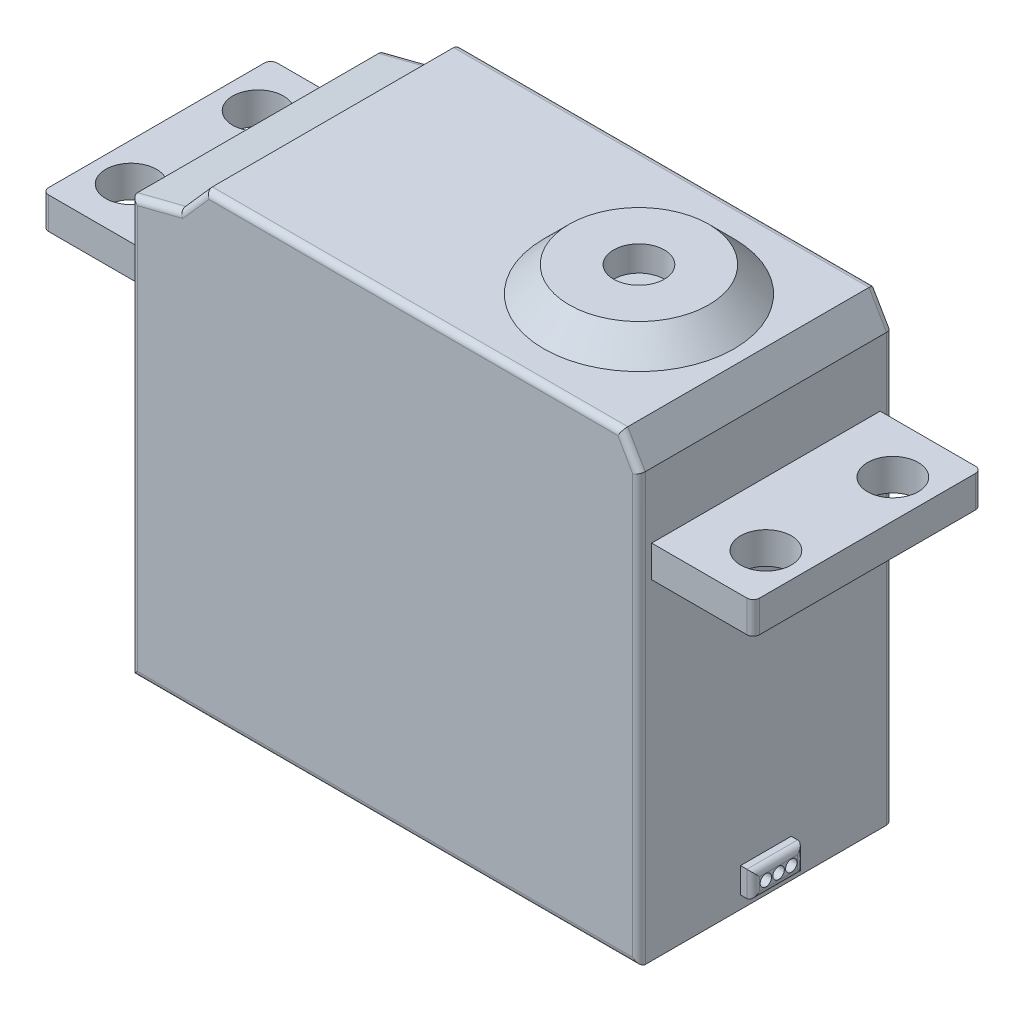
ISO-10303-21;
HEADER;
FILE_DESCRIPTION(('STEP AP214'),'2;1');
FILE_NAME('part.step','',(''),(''),'','','');
FILE_SCHEMA(('AUTOMOTIVE_DESIGN { 1 0 10303 214 1 1 1 1 }'));
ENDSEC;
DATA;
#1=APPLICATION_CONTEXT('core data for automotive mechanical design processes');
#2=APPLICATION_PROTOCOL_DEFINITION('international standard','automotive_design',2000,#1);
#3=PRODUCT_CONTEXT('',#1,'mechanical');
#4=PRODUCT('Part','Part','',(#3));
#5=PRODUCT_RELATED_PRODUCT_CATEGORY('part','',(#4));
#6=PRODUCT_DEFINITION_FORMATION('','',#4);
#7=PRODUCT_DEFINITION_CONTEXT('part definition',#1,'design');
#8=PRODUCT_DEFINITION('design','',#6,#7);
#9=PRODUCT_DEFINITION_SHAPE('','',#8);
#10=(LENGTH_UNIT() NAMED_UNIT(*) SI_UNIT(.MILLI.,.METRE.));
#11=(NAMED_UNIT(*) PLANE_ANGLE_UNIT() SI_UNIT($,.RADIAN.));
#12=(NAMED_UNIT(*) SI_UNIT($,.STERADIAN.) SOLID_ANGLE_UNIT());
#13=UNCERTAINTY_MEASURE_WITH_UNIT(LENGTH_MEASURE(1.E-05),#10,'distance_accuracy_value','');
#14=(GEOMETRIC_REPRESENTATION_CONTEXT(3) GLOBAL_UNCERTAINTY_ASSIGNED_CONTEXT((#13)) GLOBAL_UNIT_ASSIGNED_CONTEXT((#10,
#11,#12)) REPRESENTATION_CONTEXT('',''));
#15=CARTESIAN_POINT('',(0.,0.,0.));
#16=DIRECTION('',(0.,0.,1.));
#17=DIRECTION('',(1.,0.,0.));
#18=AXIS2_PLACEMENT_3D('',#15,#16,#17);
#19=CARTESIAN_POINT('',(20.,36.,10.));
#20=DIRECTION('',(-1.,0.,0.));
#21=DIRECTION('',(0.,0.,1.));
#22=AXIS2_PLACEMENT_3D('',#19,#20,#21);
#23=PLANE('',#22);
#24=DIRECTION('',(0.,0.,-1.));
#25=VECTOR('',#24,1.);
#26=CARTESIAN_POINT('',(20.,33.6232348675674,10.));
#27=LINE('',#26,#25);
#28=CARTESIAN_POINT('',(20.,33.6232348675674,9.5));
#29=VERTEX_POINT('',#28);
#30=CARTESIAN_POINT('',(20.,33.6232348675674,-9.5));
#31=VERTEX_POINT('',#30);
#32=EDGE_CURVE('E283',#29,#31,#27,.T.);
#33=ORIENTED_EDGE('',*,*,#32,.F.);
#34=DIRECTION('',(0.,-1.,0.));
#35=VECTOR('',#34,1.);
#36=CARTESIAN_POINT('',(20.,36.,9.5));
#37=LINE('',#36,#35);
#38=CARTESIAN_POINT('',(20.,0.,9.5));
#39=VERTEX_POINT('',#38);
#40=EDGE_CURVE('E430',#29,#39,#37,.T.);
#41=ORIENTED_EDGE('',*,*,#40,.T.);
#42=DIRECTION('',(0.,0.,-1.));
#43=VECTOR('',#42,1.);
#44=CARTESIAN_POINT('',(20.,0.,10.));
#45=LINE('',#44,#43);
#46=CARTESIAN_POINT('',(20.,0.,-9.5));
#47=VERTEX_POINT('',#46);
#48=EDGE_CURVE('E378',#39,#47,#45,.T.);
#49=ORIENTED_EDGE('',*,*,#48,.T.);
#50=DIRECTION('',(0.,-1.,0.));
#51=VECTOR('',#50,1.);
#52=CARTESIAN_POINT('',(20.,36.,-9.5));
#53=LINE('',#52,#51);
#54=EDGE_CURVE('E428',#47,#31,#53,.F.);
#55=ORIENTED_EDGE('',*,*,#54,.T.);
#56=EDGE_LOOP('',(#33,#41,#49,#55));
#57=FACE_BOUND('',#56,.T.);
#58=DIRECTION('',(0.,0.,-1.));
#59=VECTOR('',#58,1.);
#60=CARTESIAN_POINT('',(20.,28.5,9.));
#61=LINE('',#60,#59);
#62=CARTESIAN_POINT('',(20.,28.5,9.));
#63=VERTEX_POINT('',#62);
#64=CARTESIAN_POINT('',(20.,28.5,-9.));
#65=VERTEX_POINT('',#64);
#66=EDGE_CURVE('E359',#63,#65,#61,.T.);
#67=ORIENTED_EDGE('',*,*,#66,.T.);
#68=DIRECTION('',(0.,-1.,0.));
#69=VECTOR('',#68,1.);
#70=CARTESIAN_POINT('',(20.,28.5,-9.));
#71=LINE('',#70,#69);
#72=CARTESIAN_POINT('',(20.,26.,-9.));
#73=VERTEX_POINT('',#72);
#74=EDGE_CURVE('E369',#65,#73,#71,.T.);
#75=ORIENTED_EDGE('',*,*,#74,.T.);
#76=DIRECTION('',(0.,0.,-1.));
#77=VECTOR('',#76,1.);
#78=CARTESIAN_POINT('',(20.,26.,9.));
#79=LINE('',#78,#77);
#80=CARTESIAN_POINT('',(20.,26.,9.));
#81=VERTEX_POINT('',#80);
#82=EDGE_CURVE('E348',#81,#73,#79,.T.);
#83=ORIENTED_EDGE('',*,*,#82,.F.);
#84=DIRECTION('',(0.,-1.,0.));
#85=VECTOR('',#84,1.);
#86=CARTESIAN_POINT('',(20.,28.5,9.));
#87=LINE('',#86,#85);
#88=EDGE_CURVE('E370',#63,#81,#87,.T.);
#89=ORIENTED_EDGE('',*,*,#88,.F.);
#90=EDGE_LOOP('',(#67,#75,#83,#89));
#91=FACE_BOUND('',#90,.T.);
#92=DIRECTION('',(0.,-1.,0.));
#93=VECTOR('',#92,1.);
#94=CARTESIAN_POINT('',(20.,3.,2.));
#95=LINE('',#94,#93);
#96=CARTESIAN_POINT('',(20.,3.,2.));
#97=VERTEX_POINT('',#96);
#98=CARTESIAN_POINT('',(20.,1.,2.));
#99=VERTEX_POINT('',#98);
#100=EDGE_CURVE('E248',#97,#99,#95,.T.);
#101=ORIENTED_EDGE('',*,*,#100,.F.);
#102=DIRECTION('',(0.,0.,1.));
#103=VECTOR('',#102,1.);
#104=CARTESIAN_POINT('',(20.,3.,2.));
#105=LINE('',#104,#103);
#106=CARTESIAN_POINT('',(20.,3.,-2.));
#107=VERTEX_POINT('',#106);
#108=EDGE_CURVE('E254',#107,#97,#105,.T.);
#109=ORIENTED_EDGE('',*,*,#108,.F.);
#110=DIRECTION('',(0.,1.,0.));
#111=VECTOR('',#110,1.);
#112=CARTESIAN_POINT('',(20.,3.,-2.));
#113=LINE('',#112,#111);
#114=CARTESIAN_POINT('',(20.,1.,-2.));
#115=VERTEX_POINT('',#114);
#116=EDGE_CURVE('E267',#115,#107,#113,.T.);
#117=ORIENTED_EDGE('',*,*,#116,.F.);
#118=DIRECTION('',(0.,0.,-1.));
#119=VECTOR('',#118,1.);
#120=CARTESIAN_POINT('',(20.,1.,2.));
#121=LINE('',#120,#119);
#122=EDGE_CURVE('E262',#99,#115,#121,.T.);
#123=ORIENTED_EDGE('',*,*,#122,.F.);
#124=EDGE_LOOP('',(#101,#109,#117,#123));
#125=FACE_BOUND('',#124,.T.);
#126=ADVANCED_FACE('F31',(#57,#91,#125),#23,.F.);
#127=CARTESIAN_POINT('',(-20.,36.,10.));
#128=DIRECTION('',(0.,-1.,0.));
#129=DIRECTION('',(0.,0.,-1.));
#130=AXIS2_PLACEMENT_3D('',#127,#128,#129);
#131=PLANE('',#130);
#132=DIRECTION('',(0.,0.,-1.));
#133=VECTOR('',#132,1.);
#134=CARTESIAN_POINT('',(-14.1003851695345,36.,10.));
#135=LINE('',#134,#133);
#136=CARTESIAN_POINT('',(-14.1003851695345,36.,9.5));
#137=VERTEX_POINT('',#136);
#138=CARTESIAN_POINT('',(-14.1003851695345,36.,-9.5));
#139=VERTEX_POINT('',#138);
#140=EDGE_CURVE('E287',#137,#139,#135,.T.);
#141=ORIENTED_EDGE('',*,*,#140,.F.);
#142=DIRECTION('',(1.,0.,0.));
#143=VECTOR('',#142,1.);
#144=CARTESIAN_POINT('',(-20.,36.,9.5));
#145=LINE('',#144,#143);
#146=CARTESIAN_POINT('',(18.6207159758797,36.,9.5));
#147=VERTEX_POINT('',#146);
#148=EDGE_CURVE('E422',#137,#147,#145,.T.);
#149=ORIENTED_EDGE('',*,*,#148,.T.);
#150=DIRECTION('',(0.,0.,-1.));
#151=VECTOR('',#150,1.);
#152=CARTESIAN_POINT('',(18.6207159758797,36.,10.));
#153=LINE('',#152,#151);
#154=CARTESIAN_POINT('',(18.6207159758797,36.,-9.50000000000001));
#155=VERTEX_POINT('',#154);
#156=EDGE_CURVE('E284',#147,#155,#153,.T.);
#157=ORIENTED_EDGE('',*,*,#156,.T.);
#158=DIRECTION('',(-1.,0.,0.));
#159=VECTOR('',#158,1.);
#160=CARTESIAN_POINT('',(-20.,36.,-9.5));
#161=LINE('',#160,#159);
#162=EDGE_CURVE('E420',#155,#139,#161,.T.);
#163=ORIENTED_EDGE('',*,*,#162,.T.);
#164=EDGE_LOOP('',(#141,#149,#157,#163));
#165=FACE_BOUND('',#164,.T.);
#166=CARTESIAN_POINT('',(10.,36.,0.));
#167=DIRECTION('',(0.,-1.,0.));
#168=DIRECTION('',(0.,0.,-1.));
#169=AXIS2_PLACEMENT_3D('',#166,#167,#168);
#170=CIRCLE('',#169,7.5);
#171=CARTESIAN_POINT('',(10.,36.,-7.5));
#172=VERTEX_POINT('',#171);
#173=EDGE_CURVE('E381',#172,#172,#170,.F.);
#174=ORIENTED_EDGE('',*,*,#173,.F.);
#175=EDGE_LOOP('',(#174));
#176=FACE_BOUND('',#175,.T.);
#177=ADVANCED_FACE('F520',(#165,#176),#131,.F.);
#178=CARTESIAN_POINT('',(-20.,36.,10.));
#179=DIRECTION('',(1.,0.,0.));
#180=DIRECTION('',(0.,0.,-1.));
#181=AXIS2_PLACEMENT_3D('',#178,#179,#180);
#182=PLANE('',#181);
#183=DIRECTION('',(0.,-1.,0.));
#184=VECTOR('',#183,1.);
#185=CARTESIAN_POINT('',(-20.,28.5,-9.));
#186=LINE('',#185,#184);
#187=CARTESIAN_POINT('',(-20.,28.5,-9.00000000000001));
#188=VERTEX_POINT('',#187);
#189=CARTESIAN_POINT('',(-20.,26.,-9.00000000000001));
#190=VERTEX_POINT('',#189);
#191=EDGE_CURVE('E332',#188,#190,#186,.T.);
#192=ORIENTED_EDGE('',*,*,#191,.F.);
#193=DIRECTION('',(0.,0.,1.));
#194=VECTOR('',#193,1.);
#195=CARTESIAN_POINT('',(-20.,28.5,9.));
#196=LINE('',#195,#194);
#197=CARTESIAN_POINT('',(-20.,28.5,9.));
#198=VERTEX_POINT('',#197);
#199=EDGE_CURVE('E321',#188,#198,#196,.T.);
#200=ORIENTED_EDGE('',*,*,#199,.T.);
#201=DIRECTION('',(0.,-1.,0.));
#202=VECTOR('',#201,1.);
#203=CARTESIAN_POINT('',(-20.,28.5,9.));
#204=LINE('',#203,#202);
#205=CARTESIAN_POINT('',(-20.,26.,9.));
#206=VERTEX_POINT('',#205);
#207=EDGE_CURVE('E331',#198,#206,#204,.T.);
#208=ORIENTED_EDGE('',*,*,#207,.T.);
#209=DIRECTION('',(0.,0.,1.));
#210=VECTOR('',#209,1.);
#211=CARTESIAN_POINT('',(-20.,26.,9.));
#212=LINE('',#211,#210);
#213=EDGE_CURVE('E310',#190,#206,#212,.T.);
#214=ORIENTED_EDGE('',*,*,#213,.F.);
#215=EDGE_LOOP('',(#192,#200,#208,#214));
#216=FACE_BOUND('',#215,.T.);
#217=DIRECTION('',(0.,0.,1.));
#218=VECTOR('',#217,1.);
#219=CARTESIAN_POINT('',(-20.,0.,10.));
#220=LINE('',#219,#218);
#221=CARTESIAN_POINT('',(-20.,0.,-9.5));
#222=VERTEX_POINT('',#221);
#223=CARTESIAN_POINT('',(-20.,0.,9.5));
#224=VERTEX_POINT('',#223);
#225=EDGE_CURVE('E373',#222,#224,#220,.T.);
#226=ORIENTED_EDGE('',*,*,#225,.T.);
#227=DIRECTION('',(0.,-1.,0.));
#228=VECTOR('',#227,1.);
#229=CARTESIAN_POINT('',(-20.,36.,9.5));
#230=LINE('',#229,#228);
#231=CARTESIAN_POINT('',(-20.,32.6543520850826,9.5));
#232=VERTEX_POINT('',#231);
#233=EDGE_CURVE('E409',#224,#232,#230,.F.);
#234=ORIENTED_EDGE('',*,*,#233,.T.);
#235=DIRECTION('',(0.,0.,-1.));
#236=VECTOR('',#235,1.);
#237=CARTESIAN_POINT('',(-20.,32.6543520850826,10.));
#238=LINE('',#237,#236);
#239=CARTESIAN_POINT('',(-20.,32.6543520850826,-9.5));
#240=VERTEX_POINT('',#239);
#241=EDGE_CURVE('E290',#232,#240,#238,.T.);
#242=ORIENTED_EDGE('',*,*,#241,.T.);
#243=DIRECTION('',(0.,-1.,0.));
#244=VECTOR('',#243,1.);
#245=CARTESIAN_POINT('',(-20.,36.,-9.5));
#246=LINE('',#245,#244);
#247=EDGE_CURVE('E407',#240,#222,#246,.T.);
#248=ORIENTED_EDGE('',*,*,#247,.T.);
#249=EDGE_LOOP('',(#226,#234,#242,#248));
#250=FACE_BOUND('',#249,.T.);
#251=ADVANCED_FACE('F33',(#216,#250),#182,.F.);
#252=CARTESIAN_POINT('',(-20.,36.,10.));
#253=DIRECTION('',(0.,0.,-1.));
#254=DIRECTION('',(-1.,0.,0.));
#255=AXIS2_PLACEMENT_3D('',#252,#253,#254);
#256=PLANE('',#255);
#257=DIRECTION('',(0.,-1.,0.));
#258=VECTOR('',#257,1.);
#259=CARTESIAN_POINT('',(-19.5,36.,10.));
#260=LINE('',#259,#258);
#261=CARTESIAN_POINT('',(-19.5,32.2658025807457,10.));
#262=VERTEX_POINT('',#261);
#263=CARTESIAN_POINT('',(-19.5,0.5,10.));
#264=VERTEX_POINT('',#263);
#265=EDGE_CURVE('E397',#262,#264,#260,.T.);
#266=ORIENTED_EDGE('',*,*,#265,.T.);
#267=DIRECTION('',(1.,0.,0.));
#268=VECTOR('',#267,1.);
#269=CARTESIAN_POINT('',(20.,0.5,10.));
#270=LINE('',#269,#268);
#271=CARTESIAN_POINT('',(19.5,0.5,10.));
#272=VERTEX_POINT('',#271);
#273=EDGE_CURVE('E399',#264,#272,#270,.T.);
#274=ORIENTED_EDGE('',*,*,#273,.T.);
#275=DIRECTION('',(0.,-1.,0.));
#276=VECTOR('',#275,1.);
#277=CARTESIAN_POINT('',(19.5,36.,10.));
#278=LINE('',#277,#276);
#279=CARTESIAN_POINT('',(19.5,33.4886640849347,10.));
#280=VERTEX_POINT('',#279);
#281=EDGE_CURVE('E387',#272,#280,#278,.F.);
#282=ORIENTED_EDGE('',*,*,#281,.T.);
#283=DIRECTION('',(-0.501925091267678,0.864911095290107,0.));
#284=VECTOR('',#283,1.);
#285=CARTESIAN_POINT('',(8.45858990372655,52.5150850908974,10.));
#286=LINE('',#285,#284);
#287=CARTESIAN_POINT('',(18.3327818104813,35.5,10.));
#288=VERTEX_POINT('',#287);
#289=EDGE_CURVE('E389',#280,#288,#286,.T.);
#290=ORIENTED_EDGE('',*,*,#289,.T.);
#291=DIRECTION('',(1.,0.,0.));
#292=VECTOR('',#291,1.);
#293=CARTESIAN_POINT('',(-20.,35.5,10.));
#294=LINE('',#293,#292);
#295=CARTESIAN_POINT('',(-13.874820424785,35.5,10.));
#296=VERTEX_POINT('',#295);
#297=EDGE_CURVE('E391',#288,#296,#294,.F.);
#298=ORIENTED_EDGE('',*,*,#297,.T.);
#299=DIRECTION('',(-0.661795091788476,-0.749684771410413,0.));
#300=VECTOR('',#299,1.);
#301=CARTESIAN_POINT('',(-16.3094132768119,32.7420811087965,10.));
#302=LINE('',#301,#300);
#303=CARTESIAN_POINT('',(-15.9256681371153,33.1767895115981,10.));
#304=VERTEX_POINT('',#303);
#305=EDGE_CURVE('E393',#296,#304,#302,.T.);
#306=ORIENTED_EDGE('',*,*,#305,.T.);
#307=DIRECTION('',(-0.969022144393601,-0.246973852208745,0.));
#308=VECTOR('',#307,1.);
#309=CARTESIAN_POINT('',(-19.0758221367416,32.3739124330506,10.));
#310=LINE('',#309,#308);
#311=EDGE_CURVE('E395',#304,#262,#310,.T.);
#312=ORIENTED_EDGE('',*,*,#311,.T.);
#313=EDGE_LOOP('',(#266,#274,#282,#290,#298,#306,#312));
#314=FACE_BOUND('',#313,.T.);
#315=ADVANCED_FACE('F647',(#314),#256,.F.);
#316=CARTESIAN_POINT('',(-20.,36.,-10.));
#317=DIRECTION('',(0.,0.,1.));
#318=DIRECTION('',(1.,0.,0.));
#319=AXIS2_PLACEMENT_3D('',#316,#317,#318);
#320=PLANE('',#319);
#321=DIRECTION('',(-0.969022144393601,-0.246973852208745,0.));
#322=VECTOR('',#321,1.);
#323=CARTESIAN_POINT('',(-19.0758221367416,32.3739124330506,-10.));
#324=LINE('',#323,#322);
#325=CARTESIAN_POINT('',(-19.5,32.2658025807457,-10.));
#326=VERTEX_POINT('',#325);
#327=CARTESIAN_POINT('',(-15.9256681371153,33.1767895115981,-10.));
#328=VERTEX_POINT('',#327);
#329=EDGE_CURVE('E442',#326,#328,#324,.F.);
#330=ORIENTED_EDGE('',*,*,#329,.T.);
#331=DIRECTION('',(-0.661795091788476,-0.749684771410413,0.));
#332=VECTOR('',#331,1.);
#333=CARTESIAN_POINT('',(-16.3094132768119,32.7420811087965,-10.));
#334=LINE('',#333,#332);
#335=CARTESIAN_POINT('',(-13.874820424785,35.5,-10.));
#336=VERTEX_POINT('',#335);
#337=EDGE_CURVE('E444',#328,#336,#334,.F.);
#338=ORIENTED_EDGE('',*,*,#337,.T.);
#339=DIRECTION('',(-1.,0.,0.));
#340=VECTOR('',#339,1.);
#341=CARTESIAN_POINT('',(-20.,35.5,-10.));
#342=LINE('',#341,#340);
#343=CARTESIAN_POINT('',(18.3327818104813,35.5,-10.));
#344=VERTEX_POINT('',#343);
#345=EDGE_CURVE('E432',#336,#344,#342,.F.);
#346=ORIENTED_EDGE('',*,*,#345,.T.);
#347=DIRECTION('',(-0.501925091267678,0.864911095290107,0.));
#348=VECTOR('',#347,1.);
#349=CARTESIAN_POINT('',(8.45858990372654,52.5150850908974,-10.));
#350=LINE('',#349,#348);
#351=CARTESIAN_POINT('',(19.5,33.4886640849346,-10.));
#352=VERTEX_POINT('',#351);
#353=EDGE_CURVE('E434',#344,#352,#350,.F.);
#354=ORIENTED_EDGE('',*,*,#353,.T.);
#355=DIRECTION('',(0.,-1.,0.));
#356=VECTOR('',#355,1.);
#357=CARTESIAN_POINT('',(19.5,36.,-10.));
#358=LINE('',#357,#356);
#359=CARTESIAN_POINT('',(19.5,0.5,-10.));
#360=VERTEX_POINT('',#359);
#361=EDGE_CURVE('E436',#352,#360,#358,.T.);
#362=ORIENTED_EDGE('',*,*,#361,.T.);
#363=DIRECTION('',(-1.,0.,0.));
#364=VECTOR('',#363,1.);
#365=CARTESIAN_POINT('',(-20.,0.5,-10.));
#366=LINE('',#365,#364);
#367=CARTESIAN_POINT('',(-19.5,0.5,-10.));
#368=VERTEX_POINT('',#367);
#369=EDGE_CURVE('E438',#360,#368,#366,.T.);
#370=ORIENTED_EDGE('',*,*,#369,.T.);
#371=DIRECTION('',(0.,-1.,0.));
#372=VECTOR('',#371,1.);
#373=CARTESIAN_POINT('',(-19.5,36.,-10.));
#374=LINE('',#373,#372);
#375=EDGE_CURVE('E440',#368,#326,#374,.F.);
#376=ORIENTED_EDGE('',*,*,#375,.T.);
#377=EDGE_LOOP('',(#330,#338,#346,#354,#362,#370,#376));
#378=FACE_BOUND('',#377,.T.);
#379=ADVANCED_FACE('F786',(#378),#320,.F.);
#380=CARTESIAN_POINT('',(-20.,0.,10.));
#381=DIRECTION('',(0.,-1.,0.));
#382=DIRECTION('',(0.,0.,-1.));
#383=AXIS2_PLACEMENT_3D('',#380,#381,#382);
#384=PLANE('',#383);
#385=ORIENTED_EDGE('',*,*,#48,.F.);
#386=DIRECTION('',(1.,0.,0.));
#387=VECTOR('',#386,1.);
#388=CARTESIAN_POINT('',(-20.,0.,9.5));
#389=LINE('',#388,#387);
#390=EDGE_CURVE('E404',#39,#224,#389,.F.);
#391=ORIENTED_EDGE('',*,*,#390,.T.);
#392=ORIENTED_EDGE('',*,*,#225,.F.);
#393=DIRECTION('',(-1.,0.,0.));
#394=VECTOR('',#393,1.);
#395=CARTESIAN_POINT('',(20.,0.,-9.5));
#396=LINE('',#395,#394);
#397=EDGE_CURVE('E402',#222,#47,#396,.F.);
#398=ORIENTED_EDGE('',*,*,#397,.T.);
#399=EDGE_LOOP('',(#385,#391,#392,#398));
#400=FACE_BOUND('',#399,.T.);
#401=ADVANCED_FACE('F663',(#400),#384,.T.);
#402=CARTESIAN_POINT('',(20.,28.5,9.));
#403=DIRECTION('',(0.,0.,1.));
#404=DIRECTION('',(1.,0.,0.));
#405=AXIS2_PLACEMENT_3D('',#402,#403,#404);
#406=PLANE('',#405);
#407=DIRECTION('',(-1.,0.,0.));
#408=VECTOR('',#407,1.);
#409=CARTESIAN_POINT('',(20.,26.,9.));
#410=LINE('',#409,#408);
#411=CARTESIAN_POINT('',(27.5,26.,9.));
#412=VERTEX_POINT('',#411);
#413=EDGE_CURVE('E357',#412,#81,#410,.T.);
#414=ORIENTED_EDGE('',*,*,#413,.F.);
#415=DIRECTION('',(0.,-1.,0.));
#416=VECTOR('',#415,1.);
#417=CARTESIAN_POINT('',(27.5,28.5,9.));
#418=LINE('',#417,#416);
#419=CARTESIAN_POINT('',(27.5,28.5,9.));
#420=VERTEX_POINT('',#419);
#421=EDGE_CURVE('E54',#412,#420,#418,.F.);
#422=ORIENTED_EDGE('',*,*,#421,.T.);
#423=DIRECTION('',(-1.,0.,0.));
#424=VECTOR('',#423,1.);
#425=CARTESIAN_POINT('',(20.,28.5,9.));
#426=LINE('',#425,#424);
#427=EDGE_CURVE('E367',#420,#63,#426,.T.);
#428=ORIENTED_EDGE('',*,*,#427,.T.);
#429=ORIENTED_EDGE('',*,*,#88,.T.);
#430=EDGE_LOOP('',(#414,#422,#428,#429));
#431=FACE_BOUND('',#430,.T.);
#432=ADVANCED_FACE('F503',(#431),#406,.T.);
#433=CARTESIAN_POINT('',(28.,28.5,9.));
#434=DIRECTION('',(1.,0.,0.));
#435=DIRECTION('',(0.,0.,-1.));
#436=AXIS2_PLACEMENT_3D('',#433,#434,#435);
#437=PLANE('',#436);
#438=DIRECTION('',(0.,0.,1.));
#439=VECTOR('',#438,1.);
#440=CARTESIAN_POINT('',(28.,28.5,9.));
#441=LINE('',#440,#439);
#442=CARTESIAN_POINT('',(28.,28.5,-8.5));
#443=VERTEX_POINT('',#442);
#444=CARTESIAN_POINT('',(28.,28.5,8.5));
#445=VERTEX_POINT('',#444);
#446=EDGE_CURVE('E364',#443,#445,#441,.T.);
#447=ORIENTED_EDGE('',*,*,#446,.T.);
#448=DIRECTION('',(0.,-1.,0.));
#449=VECTOR('',#448,1.);
#450=CARTESIAN_POINT('',(28.,28.5,8.5));
#451=LINE('',#450,#449);
#452=CARTESIAN_POINT('',(28.,26.,8.5));
#453=VERTEX_POINT('',#452);
#454=EDGE_CURVE('E483',#445,#453,#451,.T.);
#455=ORIENTED_EDGE('',*,*,#454,.T.);
#456=DIRECTION('',(0.,0.,1.));
#457=VECTOR('',#456,1.);
#458=CARTESIAN_POINT('',(28.,26.,9.));
#459=LINE('',#458,#457);
#460=CARTESIAN_POINT('',(28.,26.,-8.5));
#461=VERTEX_POINT('',#460);
#462=EDGE_CURVE('E354',#461,#453,#459,.T.);
#463=ORIENTED_EDGE('',*,*,#462,.F.);
#464=DIRECTION('',(0.,-1.,0.));
#465=VECTOR('',#464,1.);
#466=CARTESIAN_POINT('',(28.,28.5,-8.5));
#467=LINE('',#466,#465);
#468=EDGE_CURVE('E481',#461,#443,#467,.F.);
#469=ORIENTED_EDGE('',*,*,#468,.T.);
#470=EDGE_LOOP('',(#447,#455,#463,#469));
#471=FACE_BOUND('',#470,.T.);
#472=ADVANCED_FACE('F497',(#471),#437,.T.);
#473=CARTESIAN_POINT('',(20.,28.5,-9.));
#474=DIRECTION('',(0.,0.,-1.));
#475=DIRECTION('',(-1.,0.,0.));
#476=AXIS2_PLACEMENT_3D('',#473,#474,#475);
#477=PLANE('',#476);
#478=DIRECTION('',(1.,0.,0.));
#479=VECTOR('',#478,1.);
#480=CARTESIAN_POINT('',(20.,28.5,-9.));
#481=LINE('',#480,#479);
#482=CARTESIAN_POINT('',(27.5,28.5,-9.));
#483=VERTEX_POINT('',#482);
#484=EDGE_CURVE('E362',#65,#483,#481,.T.);
#485=ORIENTED_EDGE('',*,*,#484,.T.);
#486=DIRECTION('',(0.,-1.,0.));
#487=VECTOR('',#486,1.);
#488=CARTESIAN_POINT('',(27.5,28.5,-9.));
#489=LINE('',#488,#487);
#490=CARTESIAN_POINT('',(27.5,26.,-9.));
#491=VERTEX_POINT('',#490);
#492=EDGE_CURVE('E11',#483,#491,#489,.T.);
#493=ORIENTED_EDGE('',*,*,#492,.T.);
#494=DIRECTION('',(1.,0.,0.));
#495=VECTOR('',#494,1.);
#496=CARTESIAN_POINT('',(20.,26.,-9.));
#497=LINE('',#496,#495);
#498=EDGE_CURVE('E351',#73,#491,#497,.T.);
#499=ORIENTED_EDGE('',*,*,#498,.F.);
#500=ORIENTED_EDGE('',*,*,#74,.F.);
#501=EDGE_LOOP('',(#485,#493,#499,#500));
#502=FACE_BOUND('',#501,.T.);
#503=ADVANCED_FACE('F508',(#502),#477,.T.);
#504=CARTESIAN_POINT('',(20.,28.5,-9.));
#505=DIRECTION('',(0.,-1.,0.));
#506=DIRECTION('',(0.,0.,-1.));
#507=AXIS2_PLACEMENT_3D('',#504,#505,#506);
#508=PLANE('',#507);
#509=CARTESIAN_POINT('',(25.,28.5,-5.));
#510=DIRECTION('',(0.,-1.,0.));
#511=DIRECTION('',(0.,0.,-1.));
#512=AXIS2_PLACEMENT_3D('',#509,#510,#511);
#513=CIRCLE('',#512,2.);
#514=CARTESIAN_POINT('',(25.,28.5,-7.));
#515=VERTEX_POINT('',#514);
#516=EDGE_CURVE('E339',#515,#515,#513,.T.);
#517=ORIENTED_EDGE('',*,*,#516,.T.);
#518=EDGE_LOOP('',(#517));
#519=FACE_BOUND('',#518,.T.);
#520=CARTESIAN_POINT('',(25.,28.5,5.));
#521=DIRECTION('',(0.,-1.,0.));
#522=DIRECTION('',(0.,0.,-1.));
#523=AXIS2_PLACEMENT_3D('',#520,#521,#522);
#524=CIRCLE('',#523,2.);
#525=CARTESIAN_POINT('',(25.,28.5,3.));
#526=VERTEX_POINT('',#525);
#527=EDGE_CURVE('E345',#526,#526,#524,.T.);
#528=ORIENTED_EDGE('',*,*,#527,.T.);
#529=EDGE_LOOP('',(#528));
#530=FACE_BOUND('',#529,.T.);
#531=ORIENTED_EDGE('',*,*,#427,.F.);
#532=CARTESIAN_POINT('',(27.5,28.5,8.5));
#533=DIRECTION('',(0.,-1.,0.));
#534=DIRECTION('',(0.,0.,-1.));
#535=AXIS2_PLACEMENT_3D('',#532,#533,#534);
#536=CIRCLE('',#535,0.5);
#537=EDGE_CURVE('E39',#420,#445,#536,.F.);
#538=ORIENTED_EDGE('',*,*,#537,.T.);
#539=ORIENTED_EDGE('',*,*,#446,.F.);
#540=CARTESIAN_POINT('',(27.5,28.5,-8.5));
#541=DIRECTION('',(0.,-1.,0.));
#542=DIRECTION('',(0.,0.,-1.));
#543=AXIS2_PLACEMENT_3D('',#540,#541,#542);
#544=CIRCLE('',#543,0.5);
#545=EDGE_CURVE('E46',#443,#483,#544,.F.);
#546=ORIENTED_EDGE('',*,*,#545,.T.);
#547=ORIENTED_EDGE('',*,*,#484,.F.);
#548=ORIENTED_EDGE('',*,*,#66,.F.);
#549=EDGE_LOOP('',(#531,#538,#539,#546,#547,#548));
#550=FACE_BOUND('',#549,.T.);
#551=ADVANCED_FACE('F492',(#519,#530,#550),#508,.F.);
#552=CARTESIAN_POINT('',(20.,26.,-9.));
#553=DIRECTION('',(0.,-1.,0.));
#554=DIRECTION('',(0.,0.,-1.));
#555=AXIS2_PLACEMENT_3D('',#552,#553,#554);
#556=PLANE('',#555);
#557=CARTESIAN_POINT('',(25.,26.,-5.));
#558=DIRECTION('',(0.,-1.,0.));
#559=DIRECTION('',(0.,0.,-1.));
#560=AXIS2_PLACEMENT_3D('',#557,#558,#559);
#561=CIRCLE('',#560,2.);
#562=CARTESIAN_POINT('',(25.,26.,-7.));
#563=VERTEX_POINT('',#562);
#564=EDGE_CURVE('E335',#563,#563,#561,.T.);
#565=ORIENTED_EDGE('',*,*,#564,.F.);
#566=EDGE_LOOP('',(#565));
#567=FACE_BOUND('',#566,.T.);
#568=CARTESIAN_POINT('',(25.,26.,5.));
#569=DIRECTION('',(0.,-1.,0.));
#570=DIRECTION('',(0.,0.,-1.));
#571=AXIS2_PLACEMENT_3D('',#568,#569,#570);
#572=CIRCLE('',#571,2.);
#573=CARTESIAN_POINT('',(25.,26.,3.));
#574=VERTEX_POINT('',#573);
#575=EDGE_CURVE('E342',#574,#574,#572,.T.);
#576=ORIENTED_EDGE('',*,*,#575,.F.);
#577=EDGE_LOOP('',(#576));
#578=FACE_BOUND('',#577,.T.);
#579=ORIENTED_EDGE('',*,*,#462,.T.);
#580=CARTESIAN_POINT('',(27.5,26.,8.5));
#581=DIRECTION('',(0.,-1.,0.));
#582=DIRECTION('',(0.,0.,-1.));
#583=AXIS2_PLACEMENT_3D('',#580,#581,#582);
#584=CIRCLE('',#583,0.5);
#585=EDGE_CURVE('E488',#453,#412,#584,.T.);
#586=ORIENTED_EDGE('',*,*,#585,.T.);
#587=ORIENTED_EDGE('',*,*,#413,.T.);
#588=ORIENTED_EDGE('',*,*,#82,.T.);
#589=ORIENTED_EDGE('',*,*,#498,.T.);
#590=CARTESIAN_POINT('',(27.5,26.,-8.5));
#591=DIRECTION('',(0.,-1.,0.));
#592=DIRECTION('',(0.,0.,-1.));
#593=AXIS2_PLACEMENT_3D('',#590,#591,#592);
#594=CIRCLE('',#593,0.5);
#595=EDGE_CURVE('E486',#491,#461,#594,.T.);
#596=ORIENTED_EDGE('',*,*,#595,.T.);
#597=EDGE_LOOP('',(#579,#586,#587,#588,#589,#596));
#598=FACE_BOUND('',#597,.T.);
#599=ADVANCED_FACE('F502',(#567,#578,#598),#556,.T.);
#600=CARTESIAN_POINT('',(25.,28.5,5.));
#601=DIRECTION('',(0.,-1.,0.));
#602=DIRECTION('',(0.,0.,-1.));
#603=AXIS2_PLACEMENT_3D('',#600,#601,#602);
#604=CYLINDRICAL_SURFACE('',#603,2.);
#605=ORIENTED_EDGE('',*,*,#527,.F.);
#606=EDGE_LOOP('',(#605));
#607=FACE_BOUND('',#606,.T.);
#608=ORIENTED_EDGE('',*,*,#575,.T.);
#609=EDGE_LOOP('',(#608));
#610=FACE_BOUND('',#609,.T.);
#611=ADVANCED_FACE('F768',(#607,#610),#604,.F.);
#612=CARTESIAN_POINT('',(25.,28.5,-5.));
#613=DIRECTION('',(0.,-1.,0.));
#614=DIRECTION('',(0.,0.,-1.));
#615=AXIS2_PLACEMENT_3D('',#612,#613,#614);
#616=CYLINDRICAL_SURFACE('',#615,2.);
#617=ORIENTED_EDGE('',*,*,#516,.F.);
#618=EDGE_LOOP('',(#617));
#619=FACE_BOUND('',#618,.T.);
#620=ORIENTED_EDGE('',*,*,#564,.T.);
#621=EDGE_LOOP('',(#620));
#622=FACE_BOUND('',#621,.T.);
#623=ADVANCED_FACE('F758',(#619,#622),#616,.F.);
#624=CARTESIAN_POINT('',(-20.,28.5,-9.));
#625=DIRECTION('',(0.,0.,-1.));
#626=DIRECTION('',(-1.,0.,0.));
#627=AXIS2_PLACEMENT_3D('',#624,#625,#626);
#628=PLANE('',#627);
#629=DIRECTION('',(1.,0.,0.));
#630=VECTOR('',#629,1.);
#631=CARTESIAN_POINT('',(-20.,26.,-9.));
#632=LINE('',#631,#630);
#633=CARTESIAN_POINT('',(-27.5,26.,-9.00000000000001));
#634=VERTEX_POINT('',#633);
#635=EDGE_CURVE('E319',#634,#190,#632,.T.);
#636=ORIENTED_EDGE('',*,*,#635,.F.);
#637=DIRECTION('',(0.,-1.,0.));
#638=VECTOR('',#637,1.);
#639=CARTESIAN_POINT('',(-27.5,28.5,-9.00000000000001));
#640=LINE('',#639,#638);
#641=CARTESIAN_POINT('',(-27.5,28.5,-9.00000000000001));
#642=VERTEX_POINT('',#641);
#643=EDGE_CURVE('E472',#634,#642,#640,.F.);
#644=ORIENTED_EDGE('',*,*,#643,.T.);
#645=DIRECTION('',(1.,0.,0.));
#646=VECTOR('',#645,1.);
#647=CARTESIAN_POINT('',(-20.,28.5,-9.));
#648=LINE('',#647,#646);
#649=EDGE_CURVE('E329',#642,#188,#648,.T.);
#650=ORIENTED_EDGE('',*,*,#649,.T.);
#651=ORIENTED_EDGE('',*,*,#191,.T.);
#652=EDGE_LOOP('',(#636,#644,#650,#651));
#653=FACE_BOUND('',#652,.T.);
#654=ADVANCED_FACE('F754',(#653),#628,.T.);
#655=CARTESIAN_POINT('',(-28.,28.5,8.99999999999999));
#656=DIRECTION('',(-1.,0.,0.));
#657=DIRECTION('',(0.,0.,1.));
#658=AXIS2_PLACEMENT_3D('',#655,#656,#657);
#659=PLANE('',#658);
#660=DIRECTION('',(0.,0.,-1.));
#661=VECTOR('',#660,1.);
#662=CARTESIAN_POINT('',(-28.,28.5,8.99999999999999));
#663=LINE('',#662,#661);
#664=CARTESIAN_POINT('',(-28.,28.5,8.49999999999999));
#665=VERTEX_POINT('',#664);
#666=CARTESIAN_POINT('',(-28.,28.5,-8.5));
#667=VERTEX_POINT('',#666);
#668=EDGE_CURVE('E326',#665,#667,#663,.T.);
#669=ORIENTED_EDGE('',*,*,#668,.T.);
#670=DIRECTION('',(0.,-1.,0.));
#671=VECTOR('',#670,1.);
#672=CARTESIAN_POINT('',(-28.,28.5,-8.5));
#673=LINE('',#672,#671);
#674=CARTESIAN_POINT('',(-28.,26.,-8.5));
#675=VERTEX_POINT('',#674);
#676=EDGE_CURVE('E465',#667,#675,#673,.T.);
#677=ORIENTED_EDGE('',*,*,#676,.T.);
#678=DIRECTION('',(0.,0.,-1.));
#679=VECTOR('',#678,1.);
#680=CARTESIAN_POINT('',(-28.,26.,8.99999999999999));
#681=LINE('',#680,#679);
#682=CARTESIAN_POINT('',(-28.,26.,8.49999999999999));
#683=VERTEX_POINT('',#682);
#684=EDGE_CURVE('E316',#683,#675,#681,.T.);
#685=ORIENTED_EDGE('',*,*,#684,.F.);
#686=DIRECTION('',(0.,-1.,0.));
#687=VECTOR('',#686,1.);
#688=CARTESIAN_POINT('',(-28.,28.5,8.49999999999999));
#689=LINE('',#688,#687);
#690=EDGE_CURVE('E463',#683,#665,#689,.F.);
#691=ORIENTED_EDGE('',*,*,#690,.T.);
#692=EDGE_LOOP('',(#669,#677,#685,#691));
#693=FACE_BOUND('',#692,.T.);
#694=ADVANCED_FACE('F757',(#693),#659,.T.);
#695=CARTESIAN_POINT('',(-20.,28.5,9.));
#696=DIRECTION('',(0.,0.,1.));
#697=DIRECTION('',(1.,0.,0.));
#698=AXIS2_PLACEMENT_3D('',#695,#696,#697);
#699=PLANE('',#698);
#700=DIRECTION('',(-1.,0.,0.));
#701=VECTOR('',#700,1.);
#702=CARTESIAN_POINT('',(-20.,28.5,9.));
#703=LINE('',#702,#701);
#704=CARTESIAN_POINT('',(-27.5,28.5,8.99999999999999));
#705=VERTEX_POINT('',#704);
#706=EDGE_CURVE('E323',#198,#705,#703,.T.);
#707=ORIENTED_EDGE('',*,*,#706,.T.);
#708=DIRECTION('',(0.,-1.,0.));
#709=VECTOR('',#708,1.);
#710=CARTESIAN_POINT('',(-27.5,28.5,8.99999999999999));
#711=LINE('',#710,#709);
#712=CARTESIAN_POINT('',(-27.5,26.,8.99999999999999));
#713=VERTEX_POINT('',#712);
#714=EDGE_CURVE('E478',#705,#713,#711,.T.);
#715=ORIENTED_EDGE('',*,*,#714,.T.);
#716=DIRECTION('',(-1.,0.,0.));
#717=VECTOR('',#716,1.);
#718=CARTESIAN_POINT('',(-20.,26.,9.));
#719=LINE('',#718,#717);
#720=EDGE_CURVE('E313',#206,#713,#719,.T.);
#721=ORIENTED_EDGE('',*,*,#720,.F.);
#722=ORIENTED_EDGE('',*,*,#207,.F.);
#723=EDGE_LOOP('',(#707,#715,#721,#722));
#724=FACE_BOUND('',#723,.T.);
#725=ADVANCED_FACE('F752',(#724),#699,.T.);
#726=CARTESIAN_POINT('',(-20.,28.5,-9.));
#727=DIRECTION('',(0.,1.,0.));
#728=DIRECTION('',(0.,0.,1.));
#729=AXIS2_PLACEMENT_3D('',#726,#727,#728);
#730=PLANE('',#729);
#731=CARTESIAN_POINT('',(-25.,28.5,-5.));
#732=DIRECTION('',(0.,-1.,0.));
#733=DIRECTION('',(0.,0.,-1.));
#734=AXIS2_PLACEMENT_3D('',#731,#732,#733);
#735=CIRCLE('',#734,2.00000000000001);
#736=CARTESIAN_POINT('',(-25.,28.5,-7.00000000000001));
#737=VERTEX_POINT('',#736);
#738=EDGE_CURVE('E301',#737,#737,#735,.T.);
#739=ORIENTED_EDGE('',*,*,#738,.T.);
#740=EDGE_LOOP('',(#739));
#741=FACE_BOUND('',#740,.T.);
#742=CARTESIAN_POINT('',(-25.,28.5,5.));
#743=DIRECTION('',(0.,-1.,0.));
#744=DIRECTION('',(0.,0.,-1.));
#745=AXIS2_PLACEMENT_3D('',#742,#743,#744);
#746=CIRCLE('',#745,2.);
#747=CARTESIAN_POINT('',(-25.,28.5,3.));
#748=VERTEX_POINT('',#747);
#749=EDGE_CURVE('E307',#748,#748,#746,.T.);
#750=ORIENTED_EDGE('',*,*,#749,.T.);
#751=EDGE_LOOP('',(#750));
#752=FACE_BOUND('',#751,.T.);
#753=ORIENTED_EDGE('',*,*,#649,.F.);
#754=CARTESIAN_POINT('',(-27.5,28.5,-8.5));
#755=DIRECTION('',(0.,1.,0.));
#756=DIRECTION('',(0.,0.,1.));
#757=AXIS2_PLACEMENT_3D('',#754,#755,#756);
#758=CIRCLE('',#757,0.5);
#759=EDGE_CURVE('E476',#642,#667,#758,.T.);
#760=ORIENTED_EDGE('',*,*,#759,.T.);
#761=ORIENTED_EDGE('',*,*,#668,.F.);
#762=CARTESIAN_POINT('',(-27.5,28.5,8.49999999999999));
#763=DIRECTION('',(0.,1.,0.));
#764=DIRECTION('',(0.,0.,1.));
#765=AXIS2_PLACEMENT_3D('',#762,#763,#764);
#766=CIRCLE('',#765,0.5);
#767=EDGE_CURVE('E474',#665,#705,#766,.T.);
#768=ORIENTED_EDGE('',*,*,#767,.T.);
#769=ORIENTED_EDGE('',*,*,#706,.F.);
#770=ORIENTED_EDGE('',*,*,#199,.F.);
#771=EDGE_LOOP('',(#753,#760,#761,#768,#769,#770));
#772=FACE_BOUND('',#771,.T.);
#773=ADVANCED_FACE('F748',(#741,#752,#772),#730,.T.);
#774=CARTESIAN_POINT('',(-20.,26.,-9.));
#775=DIRECTION('',(0.,1.,0.));
#776=DIRECTION('',(0.,0.,1.));
#777=AXIS2_PLACEMENT_3D('',#774,#775,#776);
#778=PLANE('',#777);
#779=CARTESIAN_POINT('',(-25.,26.,-5.));
#780=DIRECTION('',(0.,-1.,0.));
#781=DIRECTION('',(0.,0.,-1.));
#782=AXIS2_PLACEMENT_3D('',#779,#780,#781);
#783=CIRCLE('',#782,2.00000000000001);
#784=CARTESIAN_POINT('',(-25.,26.,-7.00000000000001));
#785=VERTEX_POINT('',#784);
#786=EDGE_CURVE('E293',#785,#785,#783,.T.);
#787=ORIENTED_EDGE('',*,*,#786,.F.);
#788=EDGE_LOOP('',(#787));
#789=FACE_BOUND('',#788,.T.);
#790=CARTESIAN_POINT('',(-25.,26.,5.));
#791=DIRECTION('',(0.,-1.,0.));
#792=DIRECTION('',(0.,0.,-1.));
#793=AXIS2_PLACEMENT_3D('',#790,#791,#792);
#794=CIRCLE('',#793,2.);
#795=CARTESIAN_POINT('',(-25.,26.,3.));
#796=VERTEX_POINT('',#795);
#797=EDGE_CURVE('E304',#796,#796,#794,.T.);
#798=ORIENTED_EDGE('',*,*,#797,.F.);
#799=EDGE_LOOP('',(#798));
#800=FACE_BOUND('',#799,.T.);
#801=ORIENTED_EDGE('',*,*,#684,.T.);
#802=CARTESIAN_POINT('',(-27.5,26.,-8.5));
#803=DIRECTION('',(0.,1.,0.));
#804=DIRECTION('',(0.,0.,1.));
#805=AXIS2_PLACEMENT_3D('',#802,#803,#804);
#806=CIRCLE('',#805,0.5);
#807=EDGE_CURVE('E470',#675,#634,#806,.F.);
#808=ORIENTED_EDGE('',*,*,#807,.T.);
#809=ORIENTED_EDGE('',*,*,#635,.T.);
#810=ORIENTED_EDGE('',*,*,#213,.T.);
#811=ORIENTED_EDGE('',*,*,#720,.T.);
#812=CARTESIAN_POINT('',(-27.5,26.,8.49999999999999));
#813=DIRECTION('',(0.,1.,0.));
#814=DIRECTION('',(0.,0.,1.));
#815=AXIS2_PLACEMENT_3D('',#812,#813,#814);
#816=CIRCLE('',#815,0.5);
#817=EDGE_CURVE('E468',#713,#683,#816,.F.);
#818=ORIENTED_EDGE('',*,*,#817,.T.);
#819=EDGE_LOOP('',(#801,#808,#809,#810,#811,#818));
#820=FACE_BOUND('',#819,.T.);
#821=ADVANCED_FACE('F744',(#789,#800,#820),#778,.F.);
#822=CARTESIAN_POINT('',(-25.,28.5,5.));
#823=DIRECTION('',(0.,-1.,0.));
#824=DIRECTION('',(0.,0.,-1.));
#825=AXIS2_PLACEMENT_3D('',#822,#823,#824);
#826=CYLINDRICAL_SURFACE('',#825,2.);
#827=ORIENTED_EDGE('',*,*,#749,.F.);
#828=EDGE_LOOP('',(#827));
#829=FACE_BOUND('',#828,.T.);
#830=ORIENTED_EDGE('',*,*,#797,.T.);
#831=EDGE_LOOP('',(#830));
#832=FACE_BOUND('',#831,.T.);
#833=ADVANCED_FACE('F740',(#829,#832),#826,.F.);
#834=CARTESIAN_POINT('',(-25.,28.5,-5.));
#835=DIRECTION('',(0.,-1.,0.));
#836=DIRECTION('',(0.,0.,-1.));
#837=AXIS2_PLACEMENT_3D('',#834,#835,#836);
#838=CYLINDRICAL_SURFACE('',#837,2.00000000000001);
#839=ORIENTED_EDGE('',*,*,#738,.F.);
#840=EDGE_LOOP('',(#839));
#841=FACE_BOUND('',#840,.T.);
#842=ORIENTED_EDGE('',*,*,#786,.T.);
#843=EDGE_LOOP('',(#842));
#844=FACE_BOUND('',#843,.T.);
#845=ADVANCED_FACE('F734',(#841,#844),#838,.F.);
#846=CARTESIAN_POINT('',(-16.1985090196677,33.6232348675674,10.));
#847=DIRECTION('',(0.246973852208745,-0.969022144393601,0.));
#848=DIRECTION('',(0.969022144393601,0.246973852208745,0.));
#849=AXIS2_PLACEMENT_3D('',#846,#847,#848);
#850=PLANE('',#849);
#851=ORIENTED_EDGE('',*,*,#241,.F.);
#852=DIRECTION('',(-0.969022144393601,-0.246973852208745,0.));
#853=VECTOR('',#852,1.);
#854=CARTESIAN_POINT('',(-16.1985090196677,33.6232348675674,9.5));
#855=LINE('',#854,#853);
#856=CARTESIAN_POINT('',(-16.1985090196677,33.6232348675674,9.5));
#857=VERTEX_POINT('',#856);
#858=EDGE_CURVE('E413',#232,#857,#855,.F.);
#859=ORIENTED_EDGE('',*,*,#858,.T.);
#860=DIRECTION('',(0.,0.,-1.));
#861=VECTOR('',#860,1.);
#862=CARTESIAN_POINT('',(-16.1985090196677,33.6232348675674,10.));
#863=LINE('',#862,#861);
#864=CARTESIAN_POINT('',(-16.1985090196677,33.6232348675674,-9.5));
#865=VERTEX_POINT('',#864);
#866=EDGE_CURVE('E294',#857,#865,#863,.T.);
#867=ORIENTED_EDGE('',*,*,#866,.T.);
#868=DIRECTION('',(-0.969022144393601,-0.246973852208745,0.));
#869=VECTOR('',#868,1.);
#870=CARTESIAN_POINT('',(-16.1985090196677,33.6232348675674,-9.5));
#871=LINE('',#870,#869);
#872=EDGE_CURVE('E411',#865,#240,#871,.T.);
#873=ORIENTED_EDGE('',*,*,#872,.T.);
#874=EDGE_LOOP('',(#851,#859,#867,#873));
#875=FACE_BOUND('',#874,.T.);
#876=ADVANCED_FACE('F679',(#875),#850,.F.);
#877=CARTESIAN_POINT('',(-14.1003851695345,36.,10.));
#878=DIRECTION('',(0.749684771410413,-0.661795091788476,0.));
#879=DIRECTION('',(0.661795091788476,0.749684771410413,0.));
#880=AXIS2_PLACEMENT_3D('',#877,#878,#879);
#881=PLANE('',#880);
#882=ORIENTED_EDGE('',*,*,#866,.F.);
#883=DIRECTION('',(-0.661795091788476,-0.749684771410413,0.));
#884=VECTOR('',#883,1.);
#885=CARTESIAN_POINT('',(-14.1003851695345,36.,9.5));
#886=LINE('',#885,#884);
#887=EDGE_CURVE('E418',#857,#137,#886,.F.);
#888=ORIENTED_EDGE('',*,*,#887,.T.);
#889=ORIENTED_EDGE('',*,*,#140,.T.);
#890=DIRECTION('',(-0.661795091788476,-0.749684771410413,0.));
#891=VECTOR('',#890,1.);
#892=CARTESIAN_POINT('',(-14.1003851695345,36.,-9.5));
#893=LINE('',#892,#891);
#894=EDGE_CURVE('E415',#139,#865,#893,.T.);
#895=ORIENTED_EDGE('',*,*,#894,.T.);
#896=EDGE_LOOP('',(#882,#888,#889,#895));
#897=FACE_BOUND('',#896,.T.);
#898=ADVANCED_FACE('F730',(#897),#881,.F.);
#899=CARTESIAN_POINT('',(18.6207159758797,36.,10.));
#900=DIRECTION('',(-0.864911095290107,-0.501925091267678,0.));
#901=DIRECTION('',(0.501925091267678,-0.864911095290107,0.));
#902=AXIS2_PLACEMENT_3D('',#899,#900,#901);
#903=PLANE('',#902);
#904=ORIENTED_EDGE('',*,*,#156,.F.);
#905=DIRECTION('',(-0.501925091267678,0.864911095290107,0.));
#906=VECTOR('',#905,1.);
#907=CARTESIAN_POINT('',(18.6207159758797,36.,9.5));
#908=LINE('',#907,#906);
#909=EDGE_CURVE('E426',#147,#29,#908,.F.);
#910=ORIENTED_EDGE('',*,*,#909,.T.);
#911=ORIENTED_EDGE('',*,*,#32,.T.);
#912=DIRECTION('',(-0.501925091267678,0.864911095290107,0.));
#913=VECTOR('',#912,1.);
#914=CARTESIAN_POINT('',(18.6207159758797,36.,-9.5));
#915=LINE('',#914,#913);
#916=EDGE_CURVE('E424',#31,#155,#915,.T.);
#917=ORIENTED_EDGE('',*,*,#916,.T.);
#918=EDGE_LOOP('',(#904,#910,#911,#917));
#919=FACE_BOUND('',#918,.T.);
#920=ADVANCED_FACE('F726',(#919),#903,.F.);
#921=CARTESIAN_POINT('',(10.,38.,0.));
#922=DIRECTION('',(0.,1.,0.));
#923=DIRECTION('',(0.,0.,1.));
#924=AXIS2_PLACEMENT_3D('',#921,#922,#923);
#925=PLANE('',#924);
#926=CARTESIAN_POINT('',(10.,38.,0.));
#927=DIRECTION('',(0.,1.,0.));
#928=DIRECTION('',(0.,0.,1.));
#929=AXIS2_PLACEMENT_3D('',#926,#927,#928);
#930=CIRCLE('',#929,5.5);
#931=CARTESIAN_POINT('',(10.,38.,5.5));
#932=VERTEX_POINT('',#931);
#933=EDGE_CURVE('E384',#932,#932,#930,.T.);
#934=ORIENTED_EDGE('',*,*,#933,.T.);
#935=EDGE_LOOP('',(#934));
#936=FACE_BOUND('',#935,.T.);
#937=CARTESIAN_POINT('',(10.,38.,0.));
#938=DIRECTION('',(0.,1.,0.));
#939=DIRECTION('',(0.,0.,1.));
#940=AXIS2_PLACEMENT_3D('',#937,#938,#939);
#941=CIRCLE('',#940,2.);
#942=CARTESIAN_POINT('',(10.,38.,2.));
#943=VERTEX_POINT('',#942);
#944=EDGE_CURVE('E280',#943,#943,#941,.T.);
#945=ORIENTED_EDGE('',*,*,#944,.F.);
#946=EDGE_LOOP('',(#945));
#947=FACE_BOUND('',#946,.T.);
#948=ADVANCED_FACE('F722',(#936,#947),#925,.T.);
#949=CARTESIAN_POINT('',(10.,38.,0.));
#950=DIRECTION('',(0.,-1.,0.));
#951=DIRECTION('',(0.,0.,-1.));
#952=AXIS2_PLACEMENT_3D('',#949,#950,#951);
#953=CYLINDRICAL_SURFACE('',#952,2.);
#954=ORIENTED_EDGE('',*,*,#944,.T.);
#955=EDGE_LOOP('',(#954));
#956=FACE_BOUND('',#955,.T.);
#957=CARTESIAN_POINT('',(10.,36.,0.));
#958=DIRECTION('',(0.,1.,0.));
#959=DIRECTION('',(0.,0.,1.));
#960=AXIS2_PLACEMENT_3D('',#957,#958,#959);
#961=CIRCLE('',#960,2.);
#962=CARTESIAN_POINT('',(10.,36.,2.));
#963=VERTEX_POINT('',#962);
#964=EDGE_CURVE('E277',#963,#963,#961,.T.);
#965=ORIENTED_EDGE('',*,*,#964,.F.);
#966=EDGE_LOOP('',(#965));
#967=FACE_BOUND('',#966,.T.);
#968=ADVANCED_FACE('F719',(#956,#967),#953,.F.);
#969=ORIENTED_EDGE('',*,*,#964,.T.);
#970=EDGE_LOOP('',(#969));
#971=FACE_BOUND('',#970,.T.);
#972=ADVANCED_FACE('F530',(#971),#131,.F.);
#973=CARTESIAN_POINT('',(10.,38.,0.));
#974=DIRECTION('',(0.,-1.,0.));
#975=DIRECTION('',(0.,0.,-1.));
#976=AXIS2_PLACEMENT_3D('',#973,#974,#975);
#977=CONICAL_SURFACE('',#976,5.5,0.785398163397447);
#978=ORIENTED_EDGE('',*,*,#173,.T.);
#979=EDGE_LOOP('',(#978));
#980=FACE_BOUND('',#979,.T.);
#981=ORIENTED_EDGE('',*,*,#933,.F.);
#982=EDGE_LOOP('',(#981));
#983=FACE_BOUND('',#982,.T.);
#984=ADVANCED_FACE('F704',(#980,#983),#977,.T.);
#985=CARTESIAN_POINT('',(21.,1.,2.));
#986=DIRECTION('',(1.,0.,0.));
#987=DIRECTION('',(0.,0.,-1.));
#988=AXIS2_PLACEMENT_3D('',#985,#986,#987);
#989=PLANE('',#988);
#990=DIRECTION('',(0.,0.,1.));
#991=VECTOR('',#990,1.);
#992=CARTESIAN_POINT('',(21.,2.5,2.));
#993=LINE('',#992,#991);
#994=CARTESIAN_POINT('',(21.,2.5,-1.5));
#995=VERTEX_POINT('',#994);
#996=CARTESIAN_POINT('',(21.,2.5,1.5));
#997=VERTEX_POINT('',#996);
#998=EDGE_CURVE('E447',#995,#997,#993,.T.);
#999=ORIENTED_EDGE('',*,*,#998,.T.);
#1000=DIRECTION('',(0.,-1.,0.));
#1001=VECTOR('',#1000,1.);
#1002=CARTESIAN_POINT('',(21.,1.,1.5));
#1003=LINE('',#1002,#1001);
#1004=CARTESIAN_POINT('',(21.,1.5,1.5));
#1005=VERTEX_POINT('',#1004);
#1006=EDGE_CURVE('E453',#997,#1005,#1003,.T.);
#1007=ORIENTED_EDGE('',*,*,#1006,.T.);
#1008=DIRECTION('',(0.,0.,-1.));
#1009=VECTOR('',#1008,1.);
#1010=CARTESIAN_POINT('',(21.,1.5,-2.));
#1011=LINE('',#1010,#1009);
#1012=CARTESIAN_POINT('',(21.,1.5,-1.5));
#1013=VERTEX_POINT('',#1012);
#1014=EDGE_CURVE('E451',#1005,#1013,#1011,.T.);
#1015=ORIENTED_EDGE('',*,*,#1014,.T.);
#1016=DIRECTION('',(0.,1.,0.));
#1017=VECTOR('',#1016,1.);
#1018=CARTESIAN_POINT('',(21.,3.,-1.5));
#1019=LINE('',#1018,#1017);
#1020=EDGE_CURVE('E449',#1013,#995,#1019,.T.);
#1021=ORIENTED_EDGE('',*,*,#1020,.T.);
#1022=EDGE_LOOP('',(#999,#1007,#1015,#1021));
#1023=FACE_BOUND('',#1022,.T.);
#1024=CARTESIAN_POINT('',(21.,2.,1.));
#1025=DIRECTION('',(1.,0.,0.));
#1026=DIRECTION('',(0.,0.,-1.));
#1027=AXIS2_PLACEMENT_3D('',#1024,#1025,#1026);
#1028=CIRCLE('',#1027,0.45);
#1029=CARTESIAN_POINT('',(21.,2.,0.55));
#1030=VERTEX_POINT('',#1029);
#1031=EDGE_CURVE('E559',#1030,#1030,#1028,.T.);
#1032=ORIENTED_EDGE('',*,*,#1031,.F.);
#1033=EDGE_LOOP('',(#1032));
#1034=FACE_BOUND('',#1033,.T.);
#1035=CARTESIAN_POINT('',(21.,2.,0.));
#1036=DIRECTION('',(1.,0.,0.));
#1037=DIRECTION('',(0.,0.,-1.));
#1038=AXIS2_PLACEMENT_3D('',#1035,#1036,#1037);
#1039=CIRCLE('',#1038,0.45);
#1040=CARTESIAN_POINT('',(21.,2.,-0.45));
#1041=VERTEX_POINT('',#1040);
#1042=EDGE_CURVE('E263',#1041,#1041,#1039,.T.);
#1043=ORIENTED_EDGE('',*,*,#1042,.F.);
#1044=EDGE_LOOP('',(#1043));
#1045=FACE_BOUND('',#1044,.T.);
#1046=CARTESIAN_POINT('',(21.,2.,-1.));
#1047=DIRECTION('',(1.,0.,0.));
#1048=DIRECTION('',(0.,0.,-1.));
#1049=AXIS2_PLACEMENT_3D('',#1046,#1047,#1048);
#1050=CIRCLE('',#1049,0.45);
#1051=CARTESIAN_POINT('',(21.,2.,-1.45));
#1052=VERTEX_POINT('',#1051);
#1053=EDGE_CURVE('E560',#1052,#1052,#1050,.T.);
#1054=ORIENTED_EDGE('',*,*,#1053,.F.);
#1055=EDGE_LOOP('',(#1054));
#1056=FACE_BOUND('',#1055,.T.);
#1057=ADVANCED_FACE('F701',(#1023,#1034,#1045,#1056),#989,.T.);
#1058=CARTESIAN_POINT('',(21.,3.,2.));
#1059=DIRECTION('',(0.,0.,-1.));
#1060=DIRECTION('',(0.,1.,0.));
#1061=AXIS2_PLACEMENT_3D('',#1058,#1059,#1060);
#1062=PLANE('',#1061);
#1063=DIRECTION('',(-1.,0.,0.));
#1064=VECTOR('',#1063,1.);
#1065=CARTESIAN_POINT('',(21.,1.,2.));
#1066=LINE('',#1065,#1064);
#1067=CARTESIAN_POINT('',(20.5,1.,2.));
#1068=VERTEX_POINT('',#1067);
#1069=EDGE_CURVE('E275',#1068,#99,#1066,.T.);
#1070=ORIENTED_EDGE('',*,*,#1069,.F.);
#1071=DIRECTION('',(0.,-1.,0.));
#1072=VECTOR('',#1071,1.);
#1073=CARTESIAN_POINT('',(20.5,3.,2.));
#1074=LINE('',#1073,#1072);
#1075=CARTESIAN_POINT('',(20.5,3.,2.));
#1076=VERTEX_POINT('',#1075);
#1077=EDGE_CURVE('E250',#1068,#1076,#1074,.F.);
#1078=ORIENTED_EDGE('',*,*,#1077,.T.);
#1079=DIRECTION('',(-1.,0.,0.));
#1080=VECTOR('',#1079,1.);
#1081=CARTESIAN_POINT('',(21.,3.,2.));
#1082=LINE('',#1081,#1080);
#1083=EDGE_CURVE('E244',#1076,#97,#1082,.T.);
#1084=ORIENTED_EDGE('',*,*,#1083,.T.);
#1085=ORIENTED_EDGE('',*,*,#100,.T.);
#1086=EDGE_LOOP('',(#1070,#1078,#1084,#1085));
#1087=FACE_BOUND('',#1086,.T.);
#1088=ADVANCED_FACE('F247',(#1087),#1062,.F.);
#1089=CARTESIAN_POINT('',(21.,1.,2.));
#1090=DIRECTION('',(0.,1.,0.));
#1091=DIRECTION('',(0.,0.,1.));
#1092=AXIS2_PLACEMENT_3D('',#1089,#1090,#1091);
#1093=PLANE('',#1092);
#1094=DIRECTION('',(-1.,0.,0.));
#1095=VECTOR('',#1094,1.);
#1096=CARTESIAN_POINT('',(21.,1.,-2.));
#1097=LINE('',#1096,#1095);
#1098=CARTESIAN_POINT('',(20.5,1.,-2.));
#1099=VERTEX_POINT('',#1098);
#1100=EDGE_CURVE('E273',#1099,#115,#1097,.T.);
#1101=ORIENTED_EDGE('',*,*,#1100,.F.);
#1102=DIRECTION('',(0.,0.,-1.));
#1103=VECTOR('',#1102,1.);
#1104=CARTESIAN_POINT('',(20.5,1.,2.));
#1105=LINE('',#1104,#1103);
#1106=EDGE_CURVE('E457',#1099,#1068,#1105,.F.);
#1107=ORIENTED_EDGE('',*,*,#1106,.T.);
#1108=ORIENTED_EDGE('',*,*,#1069,.T.);
#1109=ORIENTED_EDGE('',*,*,#122,.T.);
#1110=EDGE_LOOP('',(#1101,#1107,#1108,#1109));
#1111=FACE_BOUND('',#1110,.T.);
#1112=ADVANCED_FACE('F575',(#1111),#1093,.F.);
#1113=CARTESIAN_POINT('',(21.,3.,-2.));
#1114=DIRECTION('',(0.,0.,1.));
#1115=DIRECTION('',(0.,-1.,0.));
#1116=AXIS2_PLACEMENT_3D('',#1113,#1114,#1115);
#1117=PLANE('',#1116);
#1118=DIRECTION('',(-1.,0.,0.));
#1119=VECTOR('',#1118,1.);
#1120=CARTESIAN_POINT('',(21.,3.,-2.));
#1121=LINE('',#1120,#1119);
#1122=CARTESIAN_POINT('',(20.5,3.,-2.));
#1123=VERTEX_POINT('',#1122);
#1124=EDGE_CURVE('E253',#1123,#107,#1121,.T.);
#1125=ORIENTED_EDGE('',*,*,#1124,.F.);
#1126=DIRECTION('',(0.,1.,0.));
#1127=VECTOR('',#1126,1.);
#1128=CARTESIAN_POINT('',(20.5,1.,-2.));
#1129=LINE('',#1128,#1127);
#1130=EDGE_CURVE('E459',#1123,#1099,#1129,.F.);
#1131=ORIENTED_EDGE('',*,*,#1130,.T.);
#1132=ORIENTED_EDGE('',*,*,#1100,.T.);
#1133=ORIENTED_EDGE('',*,*,#116,.T.);
#1134=EDGE_LOOP('',(#1125,#1131,#1132,#1133));
#1135=FACE_BOUND('',#1134,.T.);
#1136=ADVANCED_FACE('F708',(#1135),#1117,.F.);
#1137=CARTESIAN_POINT('',(21.,3.,2.));
#1138=DIRECTION('',(0.,-1.,0.));
#1139=DIRECTION('',(0.,0.,-1.));
#1140=AXIS2_PLACEMENT_3D('',#1137,#1138,#1139);
#1141=PLANE('',#1140);
#1142=ORIENTED_EDGE('',*,*,#1083,.F.);
#1143=DIRECTION('',(0.,0.,1.));
#1144=VECTOR('',#1143,1.);
#1145=CARTESIAN_POINT('',(20.5,3.,-2.));
#1146=LINE('',#1145,#1144);
#1147=EDGE_CURVE('E461',#1076,#1123,#1146,.F.);
#1148=ORIENTED_EDGE('',*,*,#1147,.T.);
#1149=ORIENTED_EDGE('',*,*,#1124,.T.);
#1150=ORIENTED_EDGE('',*,*,#108,.T.);
#1151=EDGE_LOOP('',(#1142,#1148,#1149,#1150));
#1152=FACE_BOUND('',#1151,.T.);
#1153=ADVANCED_FACE('F265',(#1152),#1141,.F.);
#1154=CARTESIAN_POINT('',(21.,2.,0.));
#1155=DIRECTION('',(-1.,0.,0.));
#1156=DIRECTION('',(0.,0.,1.));
#1157=AXIS2_PLACEMENT_3D('',#1154,#1155,#1156);
#1158=CYLINDRICAL_SURFACE('',#1157,0.45);
#1159=ORIENTED_EDGE('',*,*,#1042,.T.);
#1160=EDGE_LOOP('',(#1159));
#1161=FACE_BOUND('',#1160,.T.);
#1162=CARTESIAN_POINT('',(20.,2.,0.));
#1163=DIRECTION('',(1.,0.,0.));
#1164=DIRECTION('',(0.,0.,-1.));
#1165=AXIS2_PLACEMENT_3D('',#1162,#1163,#1164);
#1166=CIRCLE('',#1165,0.45);
#1167=CARTESIAN_POINT('',(20.,2.,-0.45));
#1168=VERTEX_POINT('',#1167);
#1169=EDGE_CURVE('E563',#1168,#1168,#1166,.T.);
#1170=ORIENTED_EDGE('',*,*,#1169,.F.);
#1171=EDGE_LOOP('',(#1170));
#1172=FACE_BOUND('',#1171,.T.);
#1173=ADVANCED_FACE('F696',(#1161,#1172),#1158,.F.);
#1174=CARTESIAN_POINT('',(21.,2.,1.));
#1175=DIRECTION('',(-1.,0.,0.));
#1176=DIRECTION('',(0.,0.,1.));
#1177=AXIS2_PLACEMENT_3D('',#1174,#1175,#1176);
#1178=CYLINDRICAL_SURFACE('',#1177,0.45);
#1179=ORIENTED_EDGE('',*,*,#1031,.T.);
#1180=EDGE_LOOP('',(#1179));
#1181=FACE_BOUND('',#1180,.T.);
#1182=CARTESIAN_POINT('',(20.,2.,1.));
#1183=DIRECTION('',(1.,0.,0.));
#1184=DIRECTION('',(0.,0.,-1.));
#1185=AXIS2_PLACEMENT_3D('',#1182,#1183,#1184);
#1186=CIRCLE('',#1185,0.45);
#1187=CARTESIAN_POINT('',(20.,2.,0.55));
#1188=VERTEX_POINT('',#1187);
#1189=EDGE_CURVE('E557',#1188,#1188,#1186,.T.);
#1190=ORIENTED_EDGE('',*,*,#1189,.F.);
#1191=EDGE_LOOP('',(#1190));
#1192=FACE_BOUND('',#1191,.T.);
#1193=ADVANCED_FACE('F552',(#1181,#1192),#1178,.F.);
#1194=CARTESIAN_POINT('',(21.,2.,-1.));
#1195=DIRECTION('',(-1.,0.,0.));
#1196=DIRECTION('',(0.,0.,1.));
#1197=AXIS2_PLACEMENT_3D('',#1194,#1195,#1196);
#1198=CYLINDRICAL_SURFACE('',#1197,0.45);
#1199=ORIENTED_EDGE('',*,*,#1053,.T.);
#1200=EDGE_LOOP('',(#1199));
#1201=FACE_BOUND('',#1200,.T.);
#1202=CARTESIAN_POINT('',(20.,2.,-1.));
#1203=DIRECTION('',(1.,0.,0.));
#1204=DIRECTION('',(0.,0.,-1.));
#1205=AXIS2_PLACEMENT_3D('',#1202,#1203,#1204);
#1206=CIRCLE('',#1205,0.45);
#1207=CARTESIAN_POINT('',(20.,2.,-1.45));
#1208=VERTEX_POINT('',#1207);
#1209=EDGE_CURVE('E566',#1208,#1208,#1206,.T.);
#1210=ORIENTED_EDGE('',*,*,#1209,.F.);
#1211=EDGE_LOOP('',(#1210));
#1212=FACE_BOUND('',#1211,.T.);
#1213=ADVANCED_FACE('F547',(#1201,#1212),#1198,.F.);
#1214=ORIENTED_EDGE('',*,*,#1189,.T.);
#1215=EDGE_LOOP('',(#1214));
#1216=FACE_BOUND('',#1215,.T.);
#1217=ADVANCED_FACE('F534',(#1216),#23,.F.);
#1218=ORIENTED_EDGE('',*,*,#1169,.T.);
#1219=EDGE_LOOP('',(#1218));
#1220=FACE_BOUND('',#1219,.T.);
#1221=ADVANCED_FACE('F523',(#1220),#23,.F.);
#1222=ORIENTED_EDGE('',*,*,#1209,.T.);
#1223=EDGE_LOOP('',(#1222));
#1224=FACE_BOUND('',#1223,.T.);
#1225=ADVANCED_FACE('F524',(#1224),#23,.F.);
#1226=CARTESIAN_POINT('',(-16.3094132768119,32.7420811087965,9.5));
#1227=DIRECTION('',(-0.661795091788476,-0.749684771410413,0.));
#1228=DIRECTION('',(0.749684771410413,-0.661795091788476,0.));
#1229=AXIS2_PLACEMENT_3D('',#1226,#1227,#1228);
#1230=CYLINDRICAL_SURFACE('',#1229,0.5);
#1231=CARTESIAN_POINT('',(-15.9256681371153,33.1767895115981,9.5));
#1232=DIRECTION('',(-0.853270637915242,-0.521468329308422,0.));
#1233=DIRECTION('',(-0.521468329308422,0.853270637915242,0.));
#1234=AXIS2_PLACEMENT_3D('',#1231,#1232,#1233);
#1235=ELLIPSE('',#1234,0.523216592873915,0.5);
#1236=EDGE_CURVE('E630',#304,#857,#1235,.T.);
#1237=ORIENTED_EDGE('',*,*,#1236,.F.);
#1238=ORIENTED_EDGE('',*,*,#305,.F.);
#1239=CARTESIAN_POINT('',(-13.874820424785,35.5,9.5));
#1240=DIRECTION('',(0.911535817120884,0.411220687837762,0.));
#1241=DIRECTION('',(0.411220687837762,-0.911535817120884,0.));
#1242=AXIS2_PLACEMENT_3D('',#1239,#1240,#1241);
#1243=ELLIPSE('',#1242,0.548524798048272,0.5);
#1244=EDGE_CURVE('E633',#137,#296,#1243,.T.);
#1245=ORIENTED_EDGE('',*,*,#1244,.F.);
#1246=ORIENTED_EDGE('',*,*,#887,.F.);
#1247=EDGE_LOOP('',(#1237,#1238,#1245,#1246));
#1248=FACE_BOUND('',#1247,.T.);
#1249=ADVANCED_FACE('F537',(#1248),#1230,.T.);
#1250=CARTESIAN_POINT('',(-20.,35.5,9.5));
#1251=DIRECTION('',(1.,0.,0.));
#1252=DIRECTION('',(0.,0.,-1.));
#1253=AXIS2_PLACEMENT_3D('',#1250,#1251,#1252);
#1254=CYLINDRICAL_SURFACE('',#1253,0.5);
#1255=ORIENTED_EDGE('',*,*,#1244,.T.);
#1256=ORIENTED_EDGE('',*,*,#297,.F.);
#1257=CARTESIAN_POINT('',(18.3327818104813,35.5,9.5));
#1258=DIRECTION('',(-0.866580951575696,0.499036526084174,0.));
#1259=DIRECTION('',(0.499036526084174,0.866580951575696,0.));
#1260=AXIS2_PLACEMENT_3D('',#1257,#1258,#1259);
#1261=ELLIPSE('',#1260,0.576980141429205,0.5);
#1262=EDGE_CURVE('E627',#147,#288,#1261,.F.);
#1263=ORIENTED_EDGE('',*,*,#1262,.F.);
#1264=ORIENTED_EDGE('',*,*,#148,.F.);
#1265=EDGE_LOOP('',(#1255,#1256,#1263,#1264));
#1266=FACE_BOUND('',#1265,.T.);
#1267=ADVANCED_FACE('F542',(#1266),#1254,.T.);
#1268=CARTESIAN_POINT('',(-19.0758221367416,32.3739124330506,9.5));
#1269=DIRECTION('',(-0.969022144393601,-0.246973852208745,0.));
#1270=DIRECTION('',(0.246973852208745,-0.969022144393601,0.));
#1271=AXIS2_PLACEMENT_3D('',#1268,#1269,#1270);
#1272=CYLINDRICAL_SURFACE('',#1271,0.5);
#1273=ORIENTED_EDGE('',*,*,#1236,.T.);
#1274=ORIENTED_EDGE('',*,*,#858,.F.);
#1275=CARTESIAN_POINT('',(-19.5,32.2658025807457,9.5));
#1276=DIRECTION('',(-0.613606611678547,-0.789611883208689,0.));
#1277=DIRECTION('',(-0.789611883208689,0.613606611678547,0.));
#1278=AXIS2_PLACEMENT_3D('',#1275,#1276,#1277);
#1279=ELLIPSE('',#1278,0.633222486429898,0.5);
#1280=EDGE_CURVE('E624',#262,#232,#1279,.T.);
#1281=ORIENTED_EDGE('',*,*,#1280,.F.);
#1282=ORIENTED_EDGE('',*,*,#311,.F.);
#1283=EDGE_LOOP('',(#1273,#1274,#1281,#1282));
#1284=FACE_BOUND('',#1283,.T.);
#1285=ADVANCED_FACE('F683',(#1284),#1272,.T.);
#1286=CARTESIAN_POINT('',(8.45858990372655,52.5150850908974,9.5));
#1287=DIRECTION('',(-0.501925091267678,0.864911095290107,0.));
#1288=DIRECTION('',(-0.864911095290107,-0.501925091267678,0.));
#1289=AXIS2_PLACEMENT_3D('',#1286,#1287,#1288);
#1290=CYLINDRICAL_SURFACE('',#1289,0.5);
#1291=ORIENTED_EDGE('',*,*,#1262,.T.);
#1292=ORIENTED_EDGE('',*,*,#289,.F.);
#1293=CARTESIAN_POINT('',(19.5,33.4886640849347,9.5));
#1294=DIRECTION('',(0.259893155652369,-0.965637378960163,0.));
#1295=DIRECTION('',(-0.965637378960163,-0.259893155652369,0.));
#1296=AXIS2_PLACEMENT_3D('',#1293,#1294,#1295);
#1297=ELLIPSE('',#1296,0.517792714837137,0.5);
#1298=EDGE_CURVE('E621',#29,#280,#1297,.T.);
#1299=ORIENTED_EDGE('',*,*,#1298,.F.);
#1300=ORIENTED_EDGE('',*,*,#909,.F.);
#1301=EDGE_LOOP('',(#1291,#1292,#1299,#1300));
#1302=FACE_BOUND('',#1301,.T.);
#1303=ADVANCED_FACE('F653',(#1302),#1290,.T.);
#1304=CARTESIAN_POINT('',(-19.5,36.,9.5));
#1305=DIRECTION('',(0.,-1.,0.));
#1306=DIRECTION('',(0.,0.,-1.));
#1307=AXIS2_PLACEMENT_3D('',#1304,#1305,#1306);
#1308=CYLINDRICAL_SURFACE('',#1307,0.5);
#1309=ORIENTED_EDGE('',*,*,#1280,.T.);
#1310=ORIENTED_EDGE('',*,*,#233,.F.);
#1311=CARTESIAN_POINT('',(-19.5,0.5,9.5));
#1312=DIRECTION('',(0.707106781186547,-0.707106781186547,0.));
#1313=DIRECTION('',(-0.707106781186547,-0.707106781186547,0.));
#1314=AXIS2_PLACEMENT_3D('',#1311,#1312,#1313);
#1315=ELLIPSE('',#1314,0.707106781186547,0.5);
#1316=EDGE_CURVE('E619',#264,#224,#1315,.T.);
#1317=ORIENTED_EDGE('',*,*,#1316,.F.);
#1318=ORIENTED_EDGE('',*,*,#265,.F.);
#1319=EDGE_LOOP('',(#1309,#1310,#1317,#1318));
#1320=FACE_BOUND('',#1319,.T.);
#1321=ADVANCED_FACE('F673',(#1320),#1308,.T.);
#1322=CARTESIAN_POINT('',(19.5,36.,9.5));
#1323=DIRECTION('',(0.,-1.,0.));
#1324=DIRECTION('',(0.,0.,-1.));
#1325=AXIS2_PLACEMENT_3D('',#1322,#1323,#1324);
#1326=CYLINDRICAL_SURFACE('',#1325,0.5);
#1327=ORIENTED_EDGE('',*,*,#1298,.T.);
#1328=ORIENTED_EDGE('',*,*,#281,.F.);
#1329=CARTESIAN_POINT('',(19.5,0.5,9.5));
#1330=DIRECTION('',(-0.707106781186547,-0.707106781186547,0.));
#1331=DIRECTION('',(0.707106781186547,-0.707106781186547,0.));
#1332=AXIS2_PLACEMENT_3D('',#1329,#1330,#1331);
#1333=ELLIPSE('',#1332,0.707106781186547,0.5);
#1334=EDGE_CURVE('E617',#39,#272,#1333,.T.);
#1335=ORIENTED_EDGE('',*,*,#1334,.F.);
#1336=ORIENTED_EDGE('',*,*,#40,.F.);
#1337=EDGE_LOOP('',(#1327,#1328,#1335,#1336));
#1338=FACE_BOUND('',#1337,.T.);
#1339=ADVANCED_FACE('F657',(#1338),#1326,.T.);
#1340=CARTESIAN_POINT('',(-20.,0.5,9.5));
#1341=DIRECTION('',(-1.,0.,0.));
#1342=DIRECTION('',(0.,0.,1.));
#1343=AXIS2_PLACEMENT_3D('',#1340,#1341,#1342);
#1344=CYLINDRICAL_SURFACE('',#1343,0.5);
#1345=ORIENTED_EDGE('',*,*,#1316,.T.);
#1346=ORIENTED_EDGE('',*,*,#390,.F.);
#1347=ORIENTED_EDGE('',*,*,#1334,.T.);
#1348=ORIENTED_EDGE('',*,*,#273,.F.);
#1349=EDGE_LOOP('',(#1345,#1346,#1347,#1348));
#1350=FACE_BOUND('',#1349,.T.);
#1351=ADVANCED_FACE('F667',(#1350),#1344,.T.);
#1352=CARTESIAN_POINT('',(19.5,36.,-9.5));
#1353=DIRECTION('',(0.,-1.,0.));
#1354=DIRECTION('',(0.,0.,-1.));
#1355=AXIS2_PLACEMENT_3D('',#1352,#1353,#1354);
#1356=CYLINDRICAL_SURFACE('',#1355,0.5);
#1357=CARTESIAN_POINT('',(19.5,33.4886640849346,-9.5));
#1358=DIRECTION('',(-0.259893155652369,0.965637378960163,0.));
#1359=DIRECTION('',(-0.965637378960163,-0.259893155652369,0.));
#1360=AXIS2_PLACEMENT_3D('',#1357,#1358,#1359);
#1361=ELLIPSE('',#1360,0.517792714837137,0.5);
#1362=EDGE_CURVE('E611',#31,#352,#1361,.T.);
#1363=ORIENTED_EDGE('',*,*,#1362,.F.);
#1364=ORIENTED_EDGE('',*,*,#54,.F.);
#1365=CARTESIAN_POINT('',(19.5,0.5,-9.5));
#1366=DIRECTION('',(-0.707106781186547,-0.707106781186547,0.));
#1367=DIRECTION('',(0.707106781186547,-0.707106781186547,0.));
#1368=AXIS2_PLACEMENT_3D('',#1365,#1366,#1367);
#1369=ELLIPSE('',#1368,0.707106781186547,0.5);
#1370=EDGE_CURVE('E614',#360,#47,#1369,.T.);
#1371=ORIENTED_EDGE('',*,*,#1370,.F.);
#1372=ORIENTED_EDGE('',*,*,#361,.F.);
#1373=EDGE_LOOP('',(#1363,#1364,#1371,#1372));
#1374=FACE_BOUND('',#1373,.T.);
#1375=ADVANCED_FACE('F818',(#1374),#1356,.T.);
#1376=CARTESIAN_POINT('',(-20.,0.5,-9.5));
#1377=DIRECTION('',(1.,0.,0.));
#1378=DIRECTION('',(0.,0.,-1.));
#1379=AXIS2_PLACEMENT_3D('',#1376,#1377,#1378);
#1380=CYLINDRICAL_SURFACE('',#1379,0.5);
#1381=ORIENTED_EDGE('',*,*,#1370,.T.);
#1382=ORIENTED_EDGE('',*,*,#397,.F.);
#1383=CARTESIAN_POINT('',(-19.5,0.5,-9.5));
#1384=DIRECTION('',(0.707106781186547,-0.707106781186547,0.));
#1385=DIRECTION('',(0.707106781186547,0.707106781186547,0.));
#1386=AXIS2_PLACEMENT_3D('',#1383,#1384,#1385);
#1387=ELLIPSE('',#1386,0.707106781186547,0.5);
#1388=EDGE_CURVE('E608',#368,#222,#1387,.F.);
#1389=ORIENTED_EDGE('',*,*,#1388,.F.);
#1390=ORIENTED_EDGE('',*,*,#369,.F.);
#1391=EDGE_LOOP('',(#1381,#1382,#1389,#1390));
#1392=FACE_BOUND('',#1391,.T.);
#1393=ADVANCED_FACE('F823',(#1392),#1380,.T.);
#1394=CARTESIAN_POINT('',(18.1882604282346,35.7490374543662,-9.5));
#1395=DIRECTION('',(-0.501925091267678,0.864911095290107,0.));
#1396=DIRECTION('',(-0.864911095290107,-0.501925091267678,0.));
#1397=AXIS2_PLACEMENT_3D('',#1394,#1395,#1396);
#1398=CYLINDRICAL_SURFACE('',#1397,0.5);
#1399=ORIENTED_EDGE('',*,*,#1362,.T.);
#1400=ORIENTED_EDGE('',*,*,#353,.F.);
#1401=CARTESIAN_POINT('',(18.3327818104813,35.5,-9.5));
#1402=DIRECTION('',(-0.866580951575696,0.499036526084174,0.));
#1403=DIRECTION('',(-0.499036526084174,-0.866580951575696,0.));
#1404=AXIS2_PLACEMENT_3D('',#1401,#1402,#1403);
#1405=ELLIPSE('',#1404,0.576980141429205,0.5);
#1406=EDGE_CURVE('E605',#155,#344,#1405,.T.);
#1407=ORIENTED_EDGE('',*,*,#1406,.F.);
#1408=ORIENTED_EDGE('',*,*,#916,.F.);
#1409=EDGE_LOOP('',(#1399,#1400,#1407,#1408));
#1410=FACE_BOUND('',#1409,.T.);
#1411=ADVANCED_FACE('F814',(#1410),#1398,.T.);
#1412=CARTESIAN_POINT('',(-19.5,36.,-9.5));
#1413=DIRECTION('',(0.,-1.,0.));
#1414=DIRECTION('',(0.,0.,-1.));
#1415=AXIS2_PLACEMENT_3D('',#1412,#1413,#1414);
#1416=CYLINDRICAL_SURFACE('',#1415,0.5);
#1417=ORIENTED_EDGE('',*,*,#1388,.T.);
#1418=ORIENTED_EDGE('',*,*,#247,.F.);
#1419=CARTESIAN_POINT('',(-19.5,32.2658025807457,-9.5));
#1420=DIRECTION('',(-0.613606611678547,-0.789611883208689,0.));
#1421=DIRECTION('',(0.789611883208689,-0.613606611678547,0.));
#1422=AXIS2_PLACEMENT_3D('',#1419,#1420,#1421);
#1423=ELLIPSE('',#1422,0.633222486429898,0.5);
#1424=EDGE_CURVE('E602',#326,#240,#1423,.F.);
#1425=ORIENTED_EDGE('',*,*,#1424,.F.);
#1426=ORIENTED_EDGE('',*,*,#375,.F.);
#1427=EDGE_LOOP('',(#1417,#1418,#1425,#1426));
#1428=FACE_BOUND('',#1427,.T.);
#1429=ADVANCED_FACE('F825',(#1428),#1416,.T.);
#1430=CARTESIAN_POINT('',(-20.,35.5,-9.5));
#1431=DIRECTION('',(-1.,0.,0.));
#1432=DIRECTION('',(0.,0.,1.));
#1433=AXIS2_PLACEMENT_3D('',#1430,#1431,#1432);
#1434=CYLINDRICAL_SURFACE('',#1433,0.5);
#1435=ORIENTED_EDGE('',*,*,#1406,.T.);
#1436=ORIENTED_EDGE('',*,*,#345,.F.);
#1437=CARTESIAN_POINT('',(-13.874820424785,35.5,-9.5));
#1438=DIRECTION('',(-0.911535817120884,-0.411220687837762,0.));
#1439=DIRECTION('',(-0.411220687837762,0.911535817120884,0.));
#1440=AXIS2_PLACEMENT_3D('',#1437,#1438,#1439);
#1441=ELLIPSE('',#1440,0.548524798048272,0.5);
#1442=EDGE_CURVE('E600',#139,#336,#1441,.T.);
#1443=ORIENTED_EDGE('',*,*,#1442,.F.);
#1444=ORIENTED_EDGE('',*,*,#162,.F.);
#1445=EDGE_LOOP('',(#1435,#1436,#1443,#1444));
#1446=FACE_BOUND('',#1445,.T.);
#1447=ADVANCED_FACE('F809',(#1446),#1434,.T.);
#1448=CARTESIAN_POINT('',(-16.0750220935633,33.1387237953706,-9.5));
#1449=DIRECTION('',(-0.969022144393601,-0.246973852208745,0.));
#1450=DIRECTION('',(0.246973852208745,-0.969022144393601,0.));
#1451=AXIS2_PLACEMENT_3D('',#1448,#1449,#1450);
#1452=CYLINDRICAL_SURFACE('',#1451,0.5);
#1453=ORIENTED_EDGE('',*,*,#1424,.T.);
#1454=ORIENTED_EDGE('',*,*,#872,.F.);
#1455=CARTESIAN_POINT('',(-15.9256681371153,33.1767895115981,-9.5));
#1456=DIRECTION('',(-0.853270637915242,-0.521468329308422,0.));
#1457=DIRECTION('',(0.521468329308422,-0.853270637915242,0.));
#1458=AXIS2_PLACEMENT_3D('',#1455,#1456,#1457);
#1459=ELLIPSE('',#1458,0.523216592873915,0.5);
#1460=EDGE_CURVE('E598',#328,#865,#1459,.F.);
#1461=ORIENTED_EDGE('',*,*,#1460,.F.);
#1462=ORIENTED_EDGE('',*,*,#329,.F.);
#1463=EDGE_LOOP('',(#1453,#1454,#1461,#1462));
#1464=FACE_BOUND('',#1463,.T.);
#1465=ADVANCED_FACE('F805',(#1464),#1452,.T.);
#1466=CARTESIAN_POINT('',(-13.7255427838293,35.6691024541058,-9.5));
#1467=DIRECTION('',(-0.661795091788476,-0.749684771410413,0.));
#1468=DIRECTION('',(0.749684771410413,-0.661795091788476,0.));
#1469=AXIS2_PLACEMENT_3D('',#1466,#1467,#1468);
#1470=CYLINDRICAL_SURFACE('',#1469,0.5);
#1471=ORIENTED_EDGE('',*,*,#1442,.T.);
#1472=ORIENTED_EDGE('',*,*,#337,.F.);
#1473=ORIENTED_EDGE('',*,*,#1460,.T.);
#1474=ORIENTED_EDGE('',*,*,#894,.F.);
#1475=EDGE_LOOP('',(#1471,#1472,#1473,#1474));
#1476=FACE_BOUND('',#1475,.T.);
#1477=ADVANCED_FACE('F801',(#1476),#1470,.T.);
#1478=CARTESIAN_POINT('',(20.5,1.,-1.5));
#1479=DIRECTION('',(0.,-1.,0.));
#1480=DIRECTION('',(0.,0.,-1.));
#1481=AXIS2_PLACEMENT_3D('',#1478,#1479,#1480);
#1482=CYLINDRICAL_SURFACE('',#1481,0.5);
#1483=CARTESIAN_POINT('',(20.5,1.5,-1.5));
#1484=DIRECTION('',(0.,-0.707106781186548,0.707106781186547));
#1485=DIRECTION('',(0.,-0.707106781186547,-0.707106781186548));
#1486=AXIS2_PLACEMENT_3D('',#1483,#1484,#1485);
#1487=ELLIPSE('',#1486,0.707106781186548,0.5);
#1488=EDGE_CURVE('E591',#1099,#1013,#1487,.T.);
#1489=ORIENTED_EDGE('',*,*,#1488,.F.);
#1490=ORIENTED_EDGE('',*,*,#1130,.F.);
#1491=CARTESIAN_POINT('',(20.5,2.5,-1.5));
#1492=DIRECTION('',(0.,-0.707106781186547,-0.707106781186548));
#1493=DIRECTION('',(0.,0.707106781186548,-0.707106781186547));
#1494=AXIS2_PLACEMENT_3D('',#1491,#1492,#1493);
#1495=ELLIPSE('',#1494,0.707106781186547,0.5);
#1496=EDGE_CURVE('E595',#995,#1123,#1495,.F.);
#1497=ORIENTED_EDGE('',*,*,#1496,.F.);
#1498=ORIENTED_EDGE('',*,*,#1020,.F.);
#1499=EDGE_LOOP('',(#1489,#1490,#1497,#1498));
#1500=FACE_BOUND('',#1499,.T.);
#1501=ADVANCED_FACE('F894',(#1500),#1482,.T.);
#1502=CARTESIAN_POINT('',(20.5,2.5,2.));
#1503=DIRECTION('',(0.,0.,-1.));
#1504=DIRECTION('',(-1.,0.,0.));
#1505=AXIS2_PLACEMENT_3D('',#1502,#1503,#1504);
#1506=CYLINDRICAL_SURFACE('',#1505,0.5);
#1507=ORIENTED_EDGE('',*,*,#1496,.T.);
#1508=ORIENTED_EDGE('',*,*,#1147,.F.);
#1509=CARTESIAN_POINT('',(20.5,2.5,1.5));
#1510=DIRECTION('',(0.,0.707106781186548,-0.707106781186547));
#1511=DIRECTION('',(0.,-0.707106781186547,-0.707106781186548));
#1512=AXIS2_PLACEMENT_3D('',#1509,#1510,#1511);
#1513=ELLIPSE('',#1512,0.707106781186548,0.5);
#1514=EDGE_CURVE('E585',#997,#1076,#1513,.F.);
#1515=ORIENTED_EDGE('',*,*,#1514,.F.);
#1516=ORIENTED_EDGE('',*,*,#998,.F.);
#1517=EDGE_LOOP('',(#1507,#1508,#1515,#1516));
#1518=FACE_BOUND('',#1517,.T.);
#1519=ADVANCED_FACE('F903',(#1518),#1506,.T.);
#1520=CARTESIAN_POINT('',(20.5,1.5,2.));
#1521=DIRECTION('',(0.,0.,1.));
#1522=DIRECTION('',(1.,0.,0.));
#1523=AXIS2_PLACEMENT_3D('',#1520,#1521,#1522);
#1524=CYLINDRICAL_SURFACE('',#1523,0.5);
#1525=ORIENTED_EDGE('',*,*,#1488,.T.);
#1526=ORIENTED_EDGE('',*,*,#1014,.F.);
#1527=CARTESIAN_POINT('',(20.5,1.5,1.5));
#1528=DIRECTION('',(0.,0.707106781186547,0.707106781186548));
#1529=DIRECTION('',(0.,-0.707106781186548,0.707106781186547));
#1530=AXIS2_PLACEMENT_3D('',#1527,#1528,#1529);
#1531=ELLIPSE('',#1530,0.707106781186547,0.5);
#1532=EDGE_CURVE('E582',#1068,#1005,#1531,.T.);
#1533=ORIENTED_EDGE('',*,*,#1532,.F.);
#1534=ORIENTED_EDGE('',*,*,#1106,.F.);
#1535=EDGE_LOOP('',(#1525,#1526,#1533,#1534));
#1536=FACE_BOUND('',#1535,.T.);
#1537=ADVANCED_FACE('F589',(#1536),#1524,.T.);
#1538=CARTESIAN_POINT('',(20.5,1.,1.5));
#1539=DIRECTION('',(0.,1.,0.));
#1540=DIRECTION('',(0.,0.,1.));
#1541=AXIS2_PLACEMENT_3D('',#1538,#1539,#1540);
#1542=CYLINDRICAL_SURFACE('',#1541,0.5);
#1543=ORIENTED_EDGE('',*,*,#1514,.T.);
#1544=ORIENTED_EDGE('',*,*,#1077,.F.);
#1545=ORIENTED_EDGE('',*,*,#1532,.T.);
#1546=ORIENTED_EDGE('',*,*,#1006,.F.);
#1547=EDGE_LOOP('',(#1543,#1544,#1545,#1546));
#1548=FACE_BOUND('',#1547,.T.);
#1549=ADVANCED_FACE('F580',(#1548),#1542,.T.);
#1550=CARTESIAN_POINT('',(-27.5,28.5,-8.5));
#1551=DIRECTION('',(0.,-1.,0.));
#1552=DIRECTION('',(0.,0.,-1.));
#1553=AXIS2_PLACEMENT_3D('',#1550,#1551,#1552);
#1554=CYLINDRICAL_SURFACE('',#1553,0.5);
#1555=ORIENTED_EDGE('',*,*,#759,.F.);
#1556=ORIENTED_EDGE('',*,*,#643,.F.);
#1557=ORIENTED_EDGE('',*,*,#807,.F.);
#1558=ORIENTED_EDGE('',*,*,#676,.F.);
#1559=EDGE_LOOP('',(#1555,#1556,#1557,#1558));
#1560=FACE_BOUND('',#1559,.T.);
#1561=ADVANCED_FACE('F930',(#1560),#1554,.T.);
#1562=CARTESIAN_POINT('',(-27.5,28.5,8.49999999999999));
#1563=DIRECTION('',(0.,-1.,0.));
#1564=DIRECTION('',(0.,0.,-1.));
#1565=AXIS2_PLACEMENT_3D('',#1562,#1563,#1564);
#1566=CYLINDRICAL_SURFACE('',#1565,0.5);
#1567=ORIENTED_EDGE('',*,*,#767,.F.);
#1568=ORIENTED_EDGE('',*,*,#690,.F.);
#1569=ORIENTED_EDGE('',*,*,#817,.F.);
#1570=ORIENTED_EDGE('',*,*,#714,.F.);
#1571=EDGE_LOOP('',(#1567,#1568,#1569,#1570));
#1572=FACE_BOUND('',#1571,.T.);
#1573=ADVANCED_FACE('F517',(#1572),#1566,.T.);
#1574=CARTESIAN_POINT('',(27.5,28.5,8.5));
#1575=DIRECTION('',(0.,-1.,0.));
#1576=DIRECTION('',(0.,0.,-1.));
#1577=AXIS2_PLACEMENT_3D('',#1574,#1575,#1576);
#1578=CYLINDRICAL_SURFACE('',#1577,0.5);
#1579=ORIENTED_EDGE('',*,*,#537,.F.);
#1580=ORIENTED_EDGE('',*,*,#421,.F.);
#1581=ORIENTED_EDGE('',*,*,#585,.F.);
#1582=ORIENTED_EDGE('',*,*,#454,.F.);
#1583=EDGE_LOOP('',(#1579,#1580,#1581,#1582));
#1584=FACE_BOUND('',#1583,.T.);
#1585=ADVANCED_FACE('F500',(#1584),#1578,.T.);
#1586=CARTESIAN_POINT('',(27.5,28.5,-8.5));
#1587=DIRECTION('',(0.,-1.,0.));
#1588=DIRECTION('',(0.,0.,-1.));
#1589=AXIS2_PLACEMENT_3D('',#1586,#1587,#1588);
#1590=CYLINDRICAL_SURFACE('',#1589,0.5);
#1591=ORIENTED_EDGE('',*,*,#545,.F.);
#1592=ORIENTED_EDGE('',*,*,#468,.F.);
#1593=ORIENTED_EDGE('',*,*,#595,.F.);
#1594=ORIENTED_EDGE('',*,*,#492,.F.);
#1595=EDGE_LOOP('',(#1591,#1592,#1593,#1594));
#1596=FACE_BOUND('',#1595,.T.);
#1597=ADVANCED_FACE('F511',(#1596),#1590,.T.);
#1598=CLOSED_SHELL('',(#126,#177,#251,#315,#379,#401,#432,#472,#503,#551,#599,#611,#623,#654,
#694,#725,#773,#821,#833,#845,#876,#898,#920,#948,#968,#972,#984,#1057,#1088,#1112,#1136,#1153,
#1173,#1193,#1213,#1217,#1221,#1225,#1249,#1267,#1285,#1303,#1321,#1339,#1351,#1375,#1393,#1411,
#1429,#1447,#1465,#1477,#1501,#1519,#1537,#1549,#1561,#1573,#1585,#1597));
#1599=MANIFOLD_SOLID_BREP('B2',#1598);
#1600=ADVANCED_BREP_SHAPE_REPRESENTATION('',(#18,#1599),#14);
#1601=SHAPE_DEFINITION_REPRESENTATION(#9,#1600);
ENDSEC;
END-ISO-10303-21;
